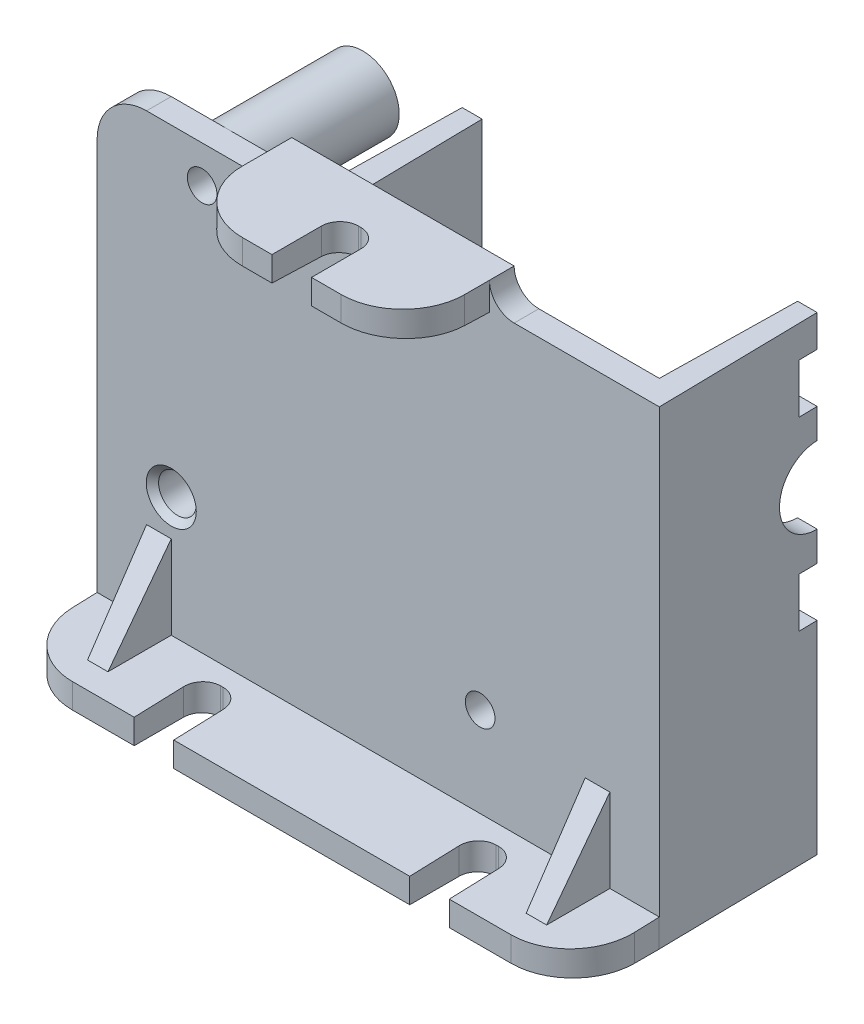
ISO-10303-21;
HEADER;
FILE_DESCRIPTION(('STEP AP214'),'2;1');
FILE_NAME('part.step','',(''),(''),'','','');
FILE_SCHEMA(('AUTOMOTIVE_DESIGN { 1 0 10303 214 1 1 1 1 }'));
ENDSEC;
DATA;
#1=APPLICATION_CONTEXT('core data for automotive mechanical design processes');
#2=APPLICATION_PROTOCOL_DEFINITION('international standard','automotive_design',2000,#1);
#3=PRODUCT_CONTEXT('',#1,'mechanical');
#4=PRODUCT('Part','Part','',(#3));
#5=PRODUCT_RELATED_PRODUCT_CATEGORY('part','',(#4));
#6=PRODUCT_DEFINITION_FORMATION('','',#4);
#7=PRODUCT_DEFINITION_CONTEXT('part definition',#1,'design');
#8=PRODUCT_DEFINITION('design','',#6,#7);
#9=PRODUCT_DEFINITION_SHAPE('','',#8);
#10=(LENGTH_UNIT() NAMED_UNIT(*) SI_UNIT(.MILLI.,.METRE.));
#11=(NAMED_UNIT(*) PLANE_ANGLE_UNIT() SI_UNIT($,.RADIAN.));
#12=(NAMED_UNIT(*) SI_UNIT($,.STERADIAN.) SOLID_ANGLE_UNIT());
#13=UNCERTAINTY_MEASURE_WITH_UNIT(LENGTH_MEASURE(1.E-05),#10,'distance_accuracy_value','');
#14=(GEOMETRIC_REPRESENTATION_CONTEXT(3) GLOBAL_UNCERTAINTY_ASSIGNED_CONTEXT((#13)) GLOBAL_UNIT_ASSIGNED_CONTEXT((#10,
#11,#12)) REPRESENTATION_CONTEXT('',''));
#15=CARTESIAN_POINT('',(0.,0.,0.));
#16=DIRECTION('',(0.,0.,1.));
#17=DIRECTION('',(1.,0.,0.));
#18=AXIS2_PLACEMENT_3D('',#15,#16,#17);
#19=CARTESIAN_POINT('',(25.2815897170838,78.3949429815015,1.27442327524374E-12));
#20=DIRECTION('',(0.,-1.,0.));
#21=DIRECTION('',(0.,0.,-1.));
#22=AXIS2_PLACEMENT_3D('',#19,#20,#21);
#23=PLANE('',#22);
#24=DIRECTION('',(0.017452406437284,0.,0.999847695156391));
#25=VECTOR('',#24,1.);
#26=CARTESIAN_POINT('',(70.9947495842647,78.3949429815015,-0.797926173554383));
#27=LINE('',#26,#25);
#28=CARTESIAN_POINT('',(70.7806270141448,78.3949429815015,-13.0649999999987));
#29=VERTEX_POINT('',#28);
#30=CARTESIAN_POINT('',(71.008677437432,78.3949429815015,1.27442327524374E-12));
#31=VERTEX_POINT('',#30);
#32=EDGE_CURVE('E507',#29,#31,#27,.T.);
#33=ORIENTED_EDGE('',*,*,#32,.F.);
#34=DIRECTION('',(-1.,0.,0.));
#35=VECTOR('',#34,1.);
#36=CARTESIAN_POINT('',(25.2815897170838,78.3949429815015,-13.0649999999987));
#37=LINE('',#36,#35);
#38=CARTESIAN_POINT('',(69.1920554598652,78.3949429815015,-13.0649999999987));
#39=VERTEX_POINT('',#38);
#40=EDGE_CURVE('E434',#29,#39,#37,.T.);
#41=ORIENTED_EDGE('',*,*,#40,.T.);
#42=DIRECTION('',(-0.0174524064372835,0.,0.999847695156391));
#43=VECTOR('',#42,1.);
#44=CARTESIAN_POINT('',(68.9990897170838,78.3949429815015,-2.00999999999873));
#45=LINE('',#44,#43);
#46=CARTESIAN_POINT('',(68.9990897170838,78.3949429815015,-2.00999999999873));
#47=VERTEX_POINT('',#46);
#48=EDGE_CURVE('E731',#47,#39,#45,.F.);
#49=ORIENTED_EDGE('',*,*,#48,.F.);
#50=DIRECTION('',(1.,0.,0.));
#51=VECTOR('',#50,1.);
#52=CARTESIAN_POINT('',(68.9990897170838,78.3949429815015,-2.00999999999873));
#53=LINE('',#52,#51);
#54=CARTESIAN_POINT('',(59.2003397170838,78.3949429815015,-2.00999999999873));
#55=VERTEX_POINT('',#54);
#56=EDGE_CURVE('E732',#55,#47,#53,.T.);
#57=ORIENTED_EDGE('',*,*,#56,.F.);
#58=DIRECTION('',(0.,0.,-1.));
#59=VECTOR('',#58,1.);
#60=CARTESIAN_POINT('',(59.2003397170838,78.3949429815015,1.27442327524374E-12));
#61=LINE('',#60,#59);
#62=CARTESIAN_POINT('',(59.2003397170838,78.3949429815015,1.27442327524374E-12));
#63=VERTEX_POINT('',#62);
#64=EDGE_CURVE('E824',#55,#63,#61,.F.);
#65=ORIENTED_EDGE('',*,*,#64,.T.);
#66=DIRECTION('',(-1.,0.,0.));
#67=VECTOR('',#66,1.);
#68=CARTESIAN_POINT('',(25.2815897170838,78.3949429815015,1.27442327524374E-12));
#69=LINE('',#68,#67);
#70=EDGE_CURVE('E737',#31,#63,#69,.T.);
#71=ORIENTED_EDGE('',*,*,#70,.F.);
#72=EDGE_LOOP('',(#33,#41,#49,#57,#65,#71));
#73=FACE_BOUND('',#72,.T.);
#74=ADVANCED_FACE('F16',(#73),#23,.F.);
#75=CARTESIAN_POINT('',(71.0090897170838,40.2049429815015,1.27442327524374E-12));
#76=DIRECTION('',(0.,0.,1.));
#77=DIRECTION('',(1.,0.,0.));
#78=AXIS2_PLACEMENT_3D('',#75,#76,#77);
#79=PLANE('',#78);
#80=CARTESIAN_POINT('',(33.8240897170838,75.3799429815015,1.27442327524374E-12));
#81=DIRECTION('',(0.,0.,1.));
#82=DIRECTION('',(1.,0.,0.));
#83=AXIS2_PLACEMENT_3D('',#80,#81,#82);
#84=CIRCLE('',#83,1.206);
#85=CARTESIAN_POINT('',(35.0300897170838,75.3799429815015,1.27442327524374E-12));
#86=VERTEX_POINT('',#85);
#87=EDGE_CURVE('E689',#86,#86,#84,.T.);
#88=ORIENTED_EDGE('',*,*,#87,.F.);
#89=EDGE_LOOP('',(#88));
#90=FACE_BOUND('',#89,.T.);
#91=CARTESIAN_POINT('',(56.4365897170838,49.7524429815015,1.27442327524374E-12));
#92=DIRECTION('',(0.,0.,1.));
#93=DIRECTION('',(1.,0.,0.));
#94=AXIS2_PLACEMENT_3D('',#91,#92,#93);
#95=CIRCLE('',#94,1.206);
#96=CARTESIAN_POINT('',(57.6425897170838,49.7524429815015,1.27442327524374E-12));
#97=VERTEX_POINT('',#96);
#98=EDGE_CURVE('E685',#97,#97,#95,.T.);
#99=ORIENTED_EDGE('',*,*,#98,.F.);
#100=EDGE_LOOP('',(#99));
#101=FACE_BOUND('',#100,.T.);
#102=CARTESIAN_POINT('',(31.3115897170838,52.1845429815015,1.27442327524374E-12));
#103=DIRECTION('',(0.,0.,1.));
#104=DIRECTION('',(1.,0.,0.));
#105=AXIS2_PLACEMENT_3D('',#102,#103,#104);
#106=CIRCLE('',#105,2.035125);
#107=CARTESIAN_POINT('',(33.3467147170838,52.1845429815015,1.27442327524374E-12));
#108=VERTEX_POINT('',#107);
#109=EDGE_CURVE('E789',#108,#108,#106,.F.);
#110=ORIENTED_EDGE('',*,*,#109,.T.);
#111=EDGE_LOOP('',(#110));
#112=FACE_BOUND('',#111,.T.);
#113=DIRECTION('',(-1.,0.,0.));
#114=VECTOR('',#113,1.);
#115=CARTESIAN_POINT('',(71.0090897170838,42.460610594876,1.27442327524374E-12));
#116=LINE('',#115,#114);
#117=CARTESIAN_POINT('',(66.9890897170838,42.460610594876,1.27442327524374E-12));
#118=VERTEX_POINT('',#117);
#119=CARTESIAN_POINT('',(71.008677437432,42.460610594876,1.27355157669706E-12));
#120=VERTEX_POINT('',#119);
#121=EDGE_CURVE('E929',#118,#120,#116,.F.);
#122=ORIENTED_EDGE('',*,*,#121,.T.);
#123=DIRECTION('',(0.,1.,0.));
#124=VECTOR('',#123,1.);
#125=CARTESIAN_POINT('',(71.008677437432,40.2049429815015,1.27442327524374E-12));
#126=LINE('',#125,#124);
#127=EDGE_CURVE('E32',#120,#31,#126,.T.);
#128=ORIENTED_EDGE('',*,*,#127,.T.);
#129=ORIENTED_EDGE('',*,*,#70,.T.);
#130=CARTESIAN_POINT('',(59.2003397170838,80.4049429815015,1.27442327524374E-12));
#131=DIRECTION('',(0.,0.,1.));
#132=DIRECTION('',(1.,0.,0.));
#133=AXIS2_PLACEMENT_3D('',#130,#131,#132);
#134=CIRCLE('',#133,2.01);
#135=CARTESIAN_POINT('',(57.1903397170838,80.4049429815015,1.27442327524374E-12));
#136=VERTEX_POINT('',#135);
#137=EDGE_CURVE('E838',#63,#136,#134,.F.);
#138=ORIENTED_EDGE('',*,*,#137,.T.);
#139=DIRECTION('',(0.,1.,0.));
#140=VECTOR('',#139,1.);
#141=CARTESIAN_POINT('',(57.1903397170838,80.4049429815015,1.27442327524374E-12));
#142=LINE('',#141,#140);
#143=CARTESIAN_POINT('',(57.1903397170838,78.1492753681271,1.27442327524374E-12));
#144=VERTEX_POINT('',#143);
#145=EDGE_CURVE('E820',#144,#136,#142,.T.);
#146=ORIENTED_EDGE('',*,*,#145,.F.);
#147=DIRECTION('',(1.,0.,0.));
#148=VECTOR('',#147,1.);
#149=CARTESIAN_POINT('',(71.0090897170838,78.1492753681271,1.27442327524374E-12));
#150=LINE('',#149,#148);
#151=CARTESIAN_POINT('',(39.1003397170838,78.1492753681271,1.27442327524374E-12));
#152=VERTEX_POINT('',#151);
#153=EDGE_CURVE('E561',#152,#144,#150,.T.);
#154=ORIENTED_EDGE('',*,*,#153,.F.);
#155=DIRECTION('',(0.,-1.,0.));
#156=VECTOR('',#155,1.);
#157=CARTESIAN_POINT('',(39.1003397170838,80.4049429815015,1.27442327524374E-12));
#158=LINE('',#157,#156);
#159=CARTESIAN_POINT('',(39.1003397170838,80.4049429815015,1.27442327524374E-12));
#160=VERTEX_POINT('',#159);
#161=EDGE_CURVE('E829',#160,#152,#158,.T.);
#162=ORIENTED_EDGE('',*,*,#161,.F.);
#163=CARTESIAN_POINT('',(37.0903397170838,80.4049429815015,1.27442327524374E-12));
#164=DIRECTION('',(0.,0.,1.));
#165=DIRECTION('',(1.,0.,0.));
#166=AXIS2_PLACEMENT_3D('',#163,#164,#165);
#167=CIRCLE('',#166,2.01);
#168=CARTESIAN_POINT('',(37.0903397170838,78.3949429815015,1.27442327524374E-12));
#169=VERTEX_POINT('',#168);
#170=EDGE_CURVE('E842',#160,#169,#167,.F.);
#171=ORIENTED_EDGE('',*,*,#170,.T.);
#172=CARTESIAN_POINT('',(29.3015897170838,78.3949429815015,1.27442327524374E-12));
#173=VERTEX_POINT('',#172);
#174=EDGE_CURVE('E741',#169,#173,#69,.T.);
#175=ORIENTED_EDGE('',*,*,#174,.T.);
#176=CARTESIAN_POINT('',(29.3015897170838,74.3749429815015,1.27442327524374E-12));
#177=DIRECTION('',(0.,0.,1.));
#178=DIRECTION('',(1.,0.,0.));
#179=AXIS2_PLACEMENT_3D('',#176,#177,#178);
#180=CIRCLE('',#179,4.02);
#181=CARTESIAN_POINT('',(25.2815897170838,74.3749429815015,1.27442327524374E-12));
#182=VERTEX_POINT('',#181);
#183=EDGE_CURVE('E778',#173,#182,#180,.T.);
#184=ORIENTED_EDGE('',*,*,#183,.T.);
#185=DIRECTION('',(0.,-1.,0.));
#186=VECTOR('',#185,1.);
#187=CARTESIAN_POINT('',(25.2815897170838,78.3949429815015,1.27442327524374E-12));
#188=LINE('',#187,#186);
#189=CARTESIAN_POINT('',(25.2815897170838,42.460610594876,1.27442327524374E-12));
#190=VERTEX_POINT('',#189);
#191=EDGE_CURVE('E740',#182,#190,#188,.T.);
#192=ORIENTED_EDGE('',*,*,#191,.T.);
#193=DIRECTION('',(-1.,0.,0.));
#194=VECTOR('',#193,1.);
#195=CARTESIAN_POINT('',(71.0090897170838,42.460610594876,1.27442327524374E-12));
#196=LINE('',#195,#194);
#197=CARTESIAN_POINT('',(29.3015897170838,42.460610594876,1.27442327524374E-12));
#198=VERTEX_POINT('',#197);
#199=EDGE_CURVE('E928',#190,#198,#196,.F.);
#200=ORIENTED_EDGE('',*,*,#199,.T.);
#201=DIRECTION('',(0.,-1.,0.));
#202=VECTOR('',#201,1.);
#203=CARTESIAN_POINT('',(29.3015897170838,40.2049429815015,1.27442327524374E-12));
#204=LINE('',#203,#202);
#205=CARTESIAN_POINT('',(29.3015897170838,49.2499429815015,1.27442327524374E-12));
#206=VERTEX_POINT('',#205);
#207=EDGE_CURVE('E857',#198,#206,#204,.F.);
#208=ORIENTED_EDGE('',*,*,#207,.T.);
#209=DIRECTION('',(-1.,0.,0.));
#210=VECTOR('',#209,1.);
#211=CARTESIAN_POINT('',(71.0090897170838,49.2499429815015,1.27442327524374E-12));
#212=LINE('',#211,#210);
#213=CARTESIAN_POINT('',(31.3115897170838,49.2499429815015,1.27442327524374E-12));
#214=VERTEX_POINT('',#213);
#215=EDGE_CURVE('E815',#214,#206,#212,.T.);
#216=ORIENTED_EDGE('',*,*,#215,.F.);
#217=DIRECTION('',(0.,1.,0.));
#218=VECTOR('',#217,1.);
#219=CARTESIAN_POINT('',(31.3115897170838,40.2049429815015,1.27442327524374E-12));
#220=LINE('',#219,#218);
#221=CARTESIAN_POINT('',(31.3115897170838,42.460610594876,1.27442327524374E-12));
#222=VERTEX_POINT('',#221);
#223=EDGE_CURVE('E861',#214,#222,#220,.F.);
#224=ORIENTED_EDGE('',*,*,#223,.T.);
#225=DIRECTION('',(-1.,0.,0.));
#226=VECTOR('',#225,1.);
#227=CARTESIAN_POINT('',(71.0090897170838,42.460610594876,1.27442327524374E-12));
#228=LINE('',#227,#226);
#229=CARTESIAN_POINT('',(64.9790897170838,42.460610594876,1.27442327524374E-12));
#230=VERTEX_POINT('',#229);
#231=EDGE_CURVE('E925',#222,#230,#228,.F.);
#232=ORIENTED_EDGE('',*,*,#231,.T.);
#233=DIRECTION('',(0.,-1.,0.));
#234=VECTOR('',#233,1.);
#235=CARTESIAN_POINT('',(64.9790897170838,40.2049429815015,1.27442327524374E-12));
#236=LINE('',#235,#234);
#237=CARTESIAN_POINT('',(64.9790897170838,49.2499429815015,1.27442327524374E-12));
#238=VERTEX_POINT('',#237);
#239=EDGE_CURVE('E869',#230,#238,#236,.F.);
#240=ORIENTED_EDGE('',*,*,#239,.T.);
#241=DIRECTION('',(-1.,0.,0.));
#242=VECTOR('',#241,1.);
#243=CARTESIAN_POINT('',(71.0090897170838,49.2499429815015,1.27442327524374E-12));
#244=LINE('',#243,#242);
#245=CARTESIAN_POINT('',(66.9890897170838,49.2499429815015,1.27442327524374E-12));
#246=VERTEX_POINT('',#245);
#247=EDGE_CURVE('E809',#246,#238,#244,.T.);
#248=ORIENTED_EDGE('',*,*,#247,.F.);
#249=DIRECTION('',(0.,1.,0.));
#250=VECTOR('',#249,1.);
#251=CARTESIAN_POINT('',(66.9890897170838,40.2049429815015,1.27442327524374E-12));
#252=LINE('',#251,#250);
#253=EDGE_CURVE('E568',#246,#118,#252,.F.);
#254=ORIENTED_EDGE('',*,*,#253,.T.);
#255=EDGE_LOOP('',(#122,#128,#129,#138,#146,#154,#162,#171,#175,#184,#192,#200,#208,#216,#224,
#232,#240,#248,#254));
#256=FACE_BOUND('',#255,.T.);
#257=ADVANCED_FACE('F3183',(#90,#101,#112,#256),#79,.T.);
#258=CARTESIAN_POINT('',(25.2815897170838,42.2149429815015,7.03500000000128));
#259=DIRECTION('',(0.,0.999390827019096,0.0348994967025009));
#260=DIRECTION('',(0.,0.0348994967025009,-0.999390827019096));
#261=AXIS2_PLACEMENT_3D('',#258,#259,#260);
#262=PLANE('',#261);
#263=DIRECTION('',(-0.017441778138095,0.0348941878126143,-0.999238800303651));
#264=VECTOR('',#263,1.);
#265=CARTESIAN_POINT('',(71.1175255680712,42.2428479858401,6.23590522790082));
#266=LINE('',#265,#264);
#267=CARTESIAN_POINT('',(71.0090897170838,42.4597857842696,0.0236194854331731));
#268=VERTEX_POINT('',#267);
#269=EDGE_CURVE('E40',#120,#268,#266,.F.);
#270=ORIENTED_EDGE('',*,*,#269,.F.);
#271=ORIENTED_EDGE('',*,*,#121,.F.);
#272=DIRECTION('',(0.0348782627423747,0.0348782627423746,-0.998782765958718));
#273=VECTOR('',#272,1.);
#274=CARTESIAN_POINT('',(66.692984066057,42.1645049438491,8.47935642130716));
#275=LINE('',#274,#273);
#276=CARTESIAN_POINT('',(66.8154084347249,42.286929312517,4.97358119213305));
#277=VERTEX_POINT('',#276);
#278=EDGE_CURVE('E880',#277,#118,#275,.T.);
#279=ORIENTED_EDGE('',*,*,#278,.F.);
#280=DIRECTION('',(-1.,0.,0.));
#281=VECTOR('',#280,1.);
#282=CARTESIAN_POINT('',(66.9890897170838,42.286929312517,4.97358119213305));
#283=LINE('',#282,#281);
#284=CARTESIAN_POINT('',(65.1527709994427,42.286929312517,4.97358119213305));
#285=VERTEX_POINT('',#284);
#286=EDGE_CURVE('E875',#285,#277,#283,.F.);
#287=ORIENTED_EDGE('',*,*,#286,.F.);
#288=DIRECTION('',(0.0348782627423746,-0.0348782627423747,0.998782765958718));
#289=VECTOR('',#288,1.);
#290=CARTESIAN_POINT('',(65.1761667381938,42.263533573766,5.64354749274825));
#291=LINE('',#290,#289);
#292=EDGE_CURVE('E814',#230,#285,#291,.T.);
#293=ORIENTED_EDGE('',*,*,#292,.F.);
#294=ORIENTED_EDGE('',*,*,#231,.F.);
#295=DIRECTION('',(0.0348782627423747,0.0348782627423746,-0.998782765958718));
#296=VECTOR('',#295,1.);
#297=CARTESIAN_POINT('',(31.0588855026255,42.2079063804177,7.23650189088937));
#298=LINE('',#297,#296);
#299=CARTESIAN_POINT('',(31.1379084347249,42.286929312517,4.97358119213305));
#300=VERTEX_POINT('',#299);
#301=EDGE_CURVE('E921',#300,#222,#298,.T.);
#302=ORIENTED_EDGE('',*,*,#301,.F.);
#303=DIRECTION('',(-1.,0.,0.));
#304=VECTOR('',#303,1.);
#305=CARTESIAN_POINT('',(31.3115897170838,42.286929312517,4.97358119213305));
#306=LINE('',#305,#304);
#307=CARTESIAN_POINT('',(29.4752709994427,42.286929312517,4.97358119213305));
#308=VERTEX_POINT('',#307);
#309=EDGE_CURVE('E862',#308,#300,#306,.F.);
#310=ORIENTED_EDGE('',*,*,#309,.F.);
#311=DIRECTION('',(0.0348782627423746,-0.0348782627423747,0.998782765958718));
#312=VECTOR('',#311,1.);
#313=CARTESIAN_POINT('',(29.5420681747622,42.2201321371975,6.88640202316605));
#314=LINE('',#313,#312);
#315=EDGE_CURVE('E813',#198,#308,#314,.T.);
#316=ORIENTED_EDGE('',*,*,#315,.F.);
#317=ORIENTED_EDGE('',*,*,#199,.F.);
#318=DIRECTION('',(0.,-0.0348994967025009,0.999390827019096));
#319=VECTOR('',#318,1.);
#320=CARTESIAN_POINT('',(25.2815897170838,42.5043777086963,-1.25332615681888));
#321=LINE('',#320,#319);
#322=CARTESIAN_POINT('',(25.2815897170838,42.3904198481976,2.01000000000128));
#323=VERTEX_POINT('',#322);
#324=EDGE_CURVE('E711',#323,#190,#321,.F.);
#325=ORIENTED_EDGE('',*,*,#324,.F.);
#326=CARTESIAN_POINT('',(30.3065897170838,42.3904198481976,2.01000000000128));
#327=DIRECTION('',(0.,0.999390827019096,0.0348994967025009));
#328=DIRECTION('',(0.,0.0348994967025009,-0.999390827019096));
#329=AXIS2_PLACEMENT_3D('',#326,#327,#328);
#330=ELLIPSE('',#329,5.02806296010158,5.025);
#331=CARTESIAN_POINT('',(30.3065897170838,42.2149429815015,7.03500000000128));
#332=VERTEX_POINT('',#331);
#333=EDGE_CURVE('E889',#323,#332,#330,.T.);
#334=ORIENTED_EDGE('',*,*,#333,.T.);
#335=DIRECTION('',(1.,0.,0.));
#336=VECTOR('',#335,1.);
#337=CARTESIAN_POINT('',(25.2815897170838,42.2149429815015,7.03500000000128));
#338=LINE('',#337,#336);
#339=CARTESIAN_POINT('',(35.3315897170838,42.2149429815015,7.03500000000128));
#340=VERTEX_POINT('',#339);
#341=EDGE_CURVE('E945',#340,#332,#338,.F.);
#342=ORIENTED_EDGE('',*,*,#341,.F.);
#343=DIRECTION('',(0.,0.0348994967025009,-0.999390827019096));
#344=VECTOR('',#343,1.);
#345=CARTESIAN_POINT('',(35.3315897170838,42.1572575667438,8.68689414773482));
#346=LINE('',#345,#344);
#347=CARTESIAN_POINT('',(35.3315897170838,42.3553244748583,3.01500000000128));
#348=VERTEX_POINT('',#347);
#349=EDGE_CURVE('E630',#348,#340,#346,.F.);
#350=ORIENTED_EDGE('',*,*,#349,.F.);
#351=CARTESIAN_POINT('',(36.8390897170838,42.3553244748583,3.01500000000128));
#352=DIRECTION('',(0.,0.999390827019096,0.0348994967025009));
#353=DIRECTION('',(0.,0.0348994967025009,-0.999390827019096));
#354=AXIS2_PLACEMENT_3D('',#351,#352,#353);
#355=ELLIPSE('',#354,1.50841888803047,1.5075);
#356=CARTESIAN_POINT('',(36.8390897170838,42.4079675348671,1.50750000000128));
#357=VERTEX_POINT('',#356);
#358=EDGE_CURVE('E981',#357,#348,#355,.T.);
#359=ORIENTED_EDGE('',*,*,#358,.F.);
#360=DIRECTION('',(1.,0.,0.));
#361=VECTOR('',#360,1.);
#362=CARTESIAN_POINT('',(36.8390897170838,42.4079675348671,1.50750000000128));
#363=LINE('',#362,#361);
#364=CARTESIAN_POINT('',(37.0400897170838,42.4079675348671,1.50750000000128));
#365=VERTEX_POINT('',#364);
#366=EDGE_CURVE('E977',#365,#357,#363,.F.);
#367=ORIENTED_EDGE('',*,*,#366,.F.);
#368=CARTESIAN_POINT('',(37.0400897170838,42.3553244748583,3.01500000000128));
#369=DIRECTION('',(0.,0.999390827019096,0.0348994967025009));
#370=DIRECTION('',(0.,0.0348994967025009,-0.999390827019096));
#371=AXIS2_PLACEMENT_3D('',#368,#369,#370);
#372=ELLIPSE('',#371,1.50841888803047,1.5075);
#373=CARTESIAN_POINT('',(38.5475897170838,42.3553244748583,3.01500000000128));
#374=VERTEX_POINT('',#373);
#375=EDGE_CURVE('E621',#374,#365,#372,.T.);
#376=ORIENTED_EDGE('',*,*,#375,.F.);
#377=DIRECTION('',(0.,0.0348994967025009,-0.999390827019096));
#378=VECTOR('',#377,1.);
#379=CARTESIAN_POINT('',(38.5475897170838,42.2149429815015,7.03500000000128));
#380=LINE('',#379,#378);
#381=CARTESIAN_POINT('',(38.5475897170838,42.2149429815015,7.03500000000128));
#382=VERTEX_POINT('',#381);
#383=EDGE_CURVE('E955',#374,#382,#380,.F.);
#384=ORIENTED_EDGE('',*,*,#383,.T.);
#385=DIRECTION('',(1.,0.,0.));
#386=VECTOR('',#385,1.);
#387=CARTESIAN_POINT('',(25.2815897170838,42.2149429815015,7.03500000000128));
#388=LINE('',#387,#386);
#389=CARTESIAN_POINT('',(57.7430897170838,42.2149429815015,7.03500000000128));
#390=VERTEX_POINT('',#389);
#391=EDGE_CURVE('E951',#390,#382,#388,.F.);
#392=ORIENTED_EDGE('',*,*,#391,.F.);
#393=DIRECTION('',(0.,0.0348994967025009,-0.999390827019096));
#394=VECTOR('',#393,1.);
#395=CARTESIAN_POINT('',(57.7430897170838,42.1572575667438,8.68689414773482));
#396=LINE('',#395,#394);
#397=CARTESIAN_POINT('',(57.7430897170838,42.3553244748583,3.01500000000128));
#398=VERTEX_POINT('',#397);
#399=EDGE_CURVE('E660',#398,#390,#396,.F.);
#400=ORIENTED_EDGE('',*,*,#399,.F.);
#401=CARTESIAN_POINT('',(59.2505897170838,42.3553244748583,3.01500000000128));
#402=DIRECTION('',(0.,0.999390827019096,0.0348994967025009));
#403=DIRECTION('',(0.,0.0348994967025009,-0.999390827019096));
#404=AXIS2_PLACEMENT_3D('',#401,#402,#403);
#405=ELLIPSE('',#404,1.50841888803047,1.5075);
#406=CARTESIAN_POINT('',(59.2505897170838,42.4079675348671,1.50750000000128));
#407=VERTEX_POINT('',#406);
#408=EDGE_CURVE('E962',#407,#398,#405,.T.);
#409=ORIENTED_EDGE('',*,*,#408,.F.);
#410=DIRECTION('',(1.,0.,0.));
#411=VECTOR('',#410,1.);
#412=CARTESIAN_POINT('',(59.4515897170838,42.4079675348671,1.50750000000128));
#413=LINE('',#412,#411);
#414=CARTESIAN_POINT('',(59.4515897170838,42.4079675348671,1.50750000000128));
#415=VERTEX_POINT('',#414);
#416=EDGE_CURVE('E958',#415,#407,#413,.F.);
#417=ORIENTED_EDGE('',*,*,#416,.F.);
#418=CARTESIAN_POINT('',(59.4515897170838,42.3553244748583,3.01500000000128));
#419=DIRECTION('',(0.,0.999390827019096,0.0348994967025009));
#420=DIRECTION('',(0.,0.0348994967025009,-0.999390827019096));
#421=AXIS2_PLACEMENT_3D('',#418,#419,#420);
#422=ELLIPSE('',#421,1.50841888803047,1.5075);
#423=CARTESIAN_POINT('',(60.9590897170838,42.3553244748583,3.01500000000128));
#424=VERTEX_POINT('',#423);
#425=EDGE_CURVE('E654',#424,#415,#422,.T.);
#426=ORIENTED_EDGE('',*,*,#425,.F.);
#427=DIRECTION('',(0.,0.0348994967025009,-0.999390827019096));
#428=VECTOR('',#427,1.);
#429=CARTESIAN_POINT('',(60.9590897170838,42.2149429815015,7.03500000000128));
#430=LINE('',#429,#428);
#431=CARTESIAN_POINT('',(60.9590897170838,42.2149429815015,7.03500000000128));
#432=VERTEX_POINT('',#431);
#433=EDGE_CURVE('E698',#424,#432,#430,.F.);
#434=ORIENTED_EDGE('',*,*,#433,.T.);
#435=DIRECTION('',(1.,0.,0.));
#436=VECTOR('',#435,1.);
#437=CARTESIAN_POINT('',(25.2815897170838,42.2149429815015,7.03500000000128));
#438=LINE('',#437,#436);
#439=CARTESIAN_POINT('',(65.9840897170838,42.2149429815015,7.03500000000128));
#440=VERTEX_POINT('',#439);
#441=EDGE_CURVE('E941',#440,#432,#438,.F.);
#442=ORIENTED_EDGE('',*,*,#441,.F.);
#443=CARTESIAN_POINT('',(65.9840897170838,42.3904198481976,2.01000000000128));
#444=DIRECTION('',(0.,0.999390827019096,0.0348994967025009));
#445=DIRECTION('',(0.,0.0348994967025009,-0.999390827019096));
#446=AXIS2_PLACEMENT_3D('',#443,#444,#445);
#447=ELLIPSE('',#446,5.02806296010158,5.025);
#448=CARTESIAN_POINT('',(71.0090897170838,42.3904198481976,2.01000000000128));
#449=VERTEX_POINT('',#448);
#450=EDGE_CURVE('E920',#440,#449,#447,.T.);
#451=ORIENTED_EDGE('',*,*,#450,.T.);
#452=DIRECTION('',(0.,0.0348994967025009,-0.999390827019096));
#453=VECTOR('',#452,1.);
#454=CARTESIAN_POINT('',(71.0090897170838,42.5043777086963,-1.25332615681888));
#455=LINE('',#454,#453);
#456=EDGE_CURVE('E942',#268,#449,#455,.F.);
#457=ORIENTED_EDGE('',*,*,#456,.F.);
#458=EDGE_LOOP('',(#270,#271,#279,#287,#293,#294,#302,#310,#316,#317,#325,#334,#342,#350,#359,
#367,#376,#384,#392,#400,#409,#417,#426,#434,#442,#451,#457));
#459=FACE_BOUND('',#458,.T.);
#460=ADVANCED_FACE('F3175',(#459),#262,.T.);
#461=CARTESIAN_POINT('',(71.0090897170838,78.3949429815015,1.27442327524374E-12));
#462=DIRECTION('',(-1.,0.,0.));
#463=DIRECTION('',(0.,0.,1.));
#464=AXIS2_PLACEMENT_3D('',#461,#462,#463);
#465=PLANE('',#464);
#466=DIRECTION('',(0.,-1.,0.));
#467=VECTOR('',#466,1.);
#468=CARTESIAN_POINT('',(71.0090897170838,78.3949429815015,0.0236194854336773));
#469=LINE('',#468,#467);
#470=CARTESIAN_POINT('',(71.0090897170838,40.2049429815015,0.0236194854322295));
#471=VERTEX_POINT('',#470);
#472=EDGE_CURVE('E499',#268,#471,#469,.T.);
#473=ORIENTED_EDGE('',*,*,#472,.F.);
#474=ORIENTED_EDGE('',*,*,#456,.T.);
#475=DIRECTION('',(0.,-1.,0.));
#476=VECTOR('',#475,1.);
#477=CARTESIAN_POINT('',(71.0090897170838,40.2049429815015,2.01000000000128));
#478=LINE('',#477,#476);
#479=CARTESIAN_POINT('',(71.0090897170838,40.2049429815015,2.01000000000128));
#480=VERTEX_POINT('',#479);
#481=EDGE_CURVE('E765',#449,#480,#478,.T.);
#482=ORIENTED_EDGE('',*,*,#481,.T.);
#483=DIRECTION('',(0.,0.,-1.));
#484=VECTOR('',#483,1.);
#485=CARTESIAN_POINT('',(71.0090897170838,40.2049429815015,1.27442327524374E-12));
#486=LINE('',#485,#484);
#487=EDGE_CURVE('E744',#480,#471,#486,.T.);
#488=ORIENTED_EDGE('',*,*,#487,.T.);
#489=EDGE_LOOP('',(#473,#474,#482,#488));
#490=FACE_BOUND('',#489,.T.);
#491=ADVANCED_FACE('F3168',(#490),#465,.F.);
#492=CARTESIAN_POINT('',(25.2815897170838,40.2049429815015,1.27442327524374E-12));
#493=DIRECTION('',(0.,1.,0.));
#494=DIRECTION('',(0.,0.,1.));
#495=AXIS2_PLACEMENT_3D('',#492,#493,#494);
#496=PLANE('',#495);
#497=DIRECTION('',(-0.017452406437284,0.,-0.999847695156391));
#498=VECTOR('',#497,1.);
#499=CARTESIAN_POINT('',(70.9947495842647,40.2049429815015,-0.797926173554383));
#500=LINE('',#499,#498);
#501=CARTESIAN_POINT('',(70.7806270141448,40.2049429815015,-13.0649999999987));
#502=VERTEX_POINT('',#501);
#503=EDGE_CURVE('E495',#471,#502,#500,.T.);
#504=ORIENTED_EDGE('',*,*,#503,.F.);
#505=ORIENTED_EDGE('',*,*,#487,.F.);
#506=CARTESIAN_POINT('',(65.9840897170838,40.2049429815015,2.01000000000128));
#507=DIRECTION('',(0.,1.,0.));
#508=DIRECTION('',(0.,0.,1.));
#509=AXIS2_PLACEMENT_3D('',#506,#507,#508);
#510=CIRCLE('',#509,5.025);
#511=CARTESIAN_POINT('',(65.9840897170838,40.2049429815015,7.03500000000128));
#512=VERTEX_POINT('',#511);
#513=EDGE_CURVE('E758',#480,#512,#510,.F.);
#514=ORIENTED_EDGE('',*,*,#513,.T.);
#515=DIRECTION('',(-1.,0.,0.));
#516=VECTOR('',#515,1.);
#517=CARTESIAN_POINT('',(25.2815897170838,40.2049429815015,7.03500000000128));
#518=LINE('',#517,#516);
#519=CARTESIAN_POINT('',(60.9590897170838,40.2049429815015,7.03500000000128));
#520=VERTEX_POINT('',#519);
#521=EDGE_CURVE('E708',#512,#520,#518,.T.);
#522=ORIENTED_EDGE('',*,*,#521,.T.);
#523=DIRECTION('',(0.,0.,-1.));
#524=VECTOR('',#523,1.);
#525=CARTESIAN_POINT('',(60.9590897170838,40.2049429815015,8.61871782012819));
#526=LINE('',#525,#524);
#527=CARTESIAN_POINT('',(60.9590897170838,40.2049429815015,3.01500000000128));
#528=VERTEX_POINT('',#527);
#529=EDGE_CURVE('E672',#520,#528,#526,.T.);
#530=ORIENTED_EDGE('',*,*,#529,.T.);
#531=CARTESIAN_POINT('',(59.4515897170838,40.2049429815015,3.01500000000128));
#532=DIRECTION('',(0.,1.,0.));
#533=DIRECTION('',(0.,0.,-1.));
#534=AXIS2_PLACEMENT_3D('',#531,#532,#533);
#535=CIRCLE('',#534,1.5075);
#536=CARTESIAN_POINT('',(59.4515897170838,40.2049429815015,1.50750000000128));
#537=VERTEX_POINT('',#536);
#538=EDGE_CURVE('E655',#528,#537,#535,.T.);
#539=ORIENTED_EDGE('',*,*,#538,.T.);
#540=DIRECTION('',(-1.,0.,0.));
#541=VECTOR('',#540,1.);
#542=CARTESIAN_POINT('',(59.4515897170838,40.2049429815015,1.50750000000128));
#543=LINE('',#542,#541);
#544=CARTESIAN_POINT('',(59.2505897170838,40.2049429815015,1.50750000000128));
#545=VERTEX_POINT('',#544);
#546=EDGE_CURVE('E659',#537,#545,#543,.T.);
#547=ORIENTED_EDGE('',*,*,#546,.T.);
#548=CARTESIAN_POINT('',(59.2505897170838,40.2049429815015,3.01500000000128));
#549=DIRECTION('',(0.,1.,0.));
#550=DIRECTION('',(0.,0.,-1.));
#551=AXIS2_PLACEMENT_3D('',#548,#549,#550);
#552=CIRCLE('',#551,1.5075);
#553=CARTESIAN_POINT('',(57.7430897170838,40.2049429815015,3.01500000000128));
#554=VERTEX_POINT('',#553);
#555=EDGE_CURVE('E664',#545,#554,#552,.T.);
#556=ORIENTED_EDGE('',*,*,#555,.T.);
#557=DIRECTION('',(0.,0.,1.));
#558=VECTOR('',#557,1.);
#559=CARTESIAN_POINT('',(57.7430897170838,40.2049429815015,8.61871782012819));
#560=LINE('',#559,#558);
#561=CARTESIAN_POINT('',(57.7430897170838,40.2049429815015,7.03500000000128));
#562=VERTEX_POINT('',#561);
#563=EDGE_CURVE('E668',#554,#562,#560,.T.);
#564=ORIENTED_EDGE('',*,*,#563,.T.);
#565=CARTESIAN_POINT('',(38.5475897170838,40.2049429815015,7.03500000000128));
#566=VERTEX_POINT('',#565);
#567=EDGE_CURVE('E712',#562,#566,#518,.T.);
#568=ORIENTED_EDGE('',*,*,#567,.T.);
#569=DIRECTION('',(0.,0.,-1.));
#570=VECTOR('',#569,1.);
#571=CARTESIAN_POINT('',(38.5475897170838,40.2049429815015,8.61871782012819));
#572=LINE('',#571,#570);
#573=CARTESIAN_POINT('',(38.5475897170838,40.2049429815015,3.01500000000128));
#574=VERTEX_POINT('',#573);
#575=EDGE_CURVE('E642',#566,#574,#572,.T.);
#576=ORIENTED_EDGE('',*,*,#575,.T.);
#577=CARTESIAN_POINT('',(37.0400897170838,40.2049429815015,3.01500000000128));
#578=DIRECTION('',(0.,1.,0.));
#579=DIRECTION('',(0.,0.,1.));
#580=AXIS2_PLACEMENT_3D('',#577,#578,#579);
#581=CIRCLE('',#580,1.5075);
#582=CARTESIAN_POINT('',(37.0400897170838,40.2049429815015,1.50750000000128));
#583=VERTEX_POINT('',#582);
#584=EDGE_CURVE('E625',#574,#583,#581,.T.);
#585=ORIENTED_EDGE('',*,*,#584,.T.);
#586=DIRECTION('',(-1.,0.,0.));
#587=VECTOR('',#586,1.);
#588=CARTESIAN_POINT('',(36.8390897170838,40.2049429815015,1.50750000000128));
#589=LINE('',#588,#587);
#590=CARTESIAN_POINT('',(36.8390897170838,40.2049429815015,1.50750000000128));
#591=VERTEX_POINT('',#590);
#592=EDGE_CURVE('E629',#583,#591,#589,.T.);
#593=ORIENTED_EDGE('',*,*,#592,.T.);
#594=CARTESIAN_POINT('',(36.8390897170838,40.2049429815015,3.01500000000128));
#595=DIRECTION('',(0.,1.,0.));
#596=DIRECTION('',(0.,0.,1.));
#597=AXIS2_PLACEMENT_3D('',#594,#595,#596);
#598=CIRCLE('',#597,1.5075);
#599=CARTESIAN_POINT('',(35.3315897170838,40.2049429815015,3.01500000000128));
#600=VERTEX_POINT('',#599);
#601=EDGE_CURVE('E634',#591,#600,#598,.T.);
#602=ORIENTED_EDGE('',*,*,#601,.T.);
#603=DIRECTION('',(0.,0.,1.));
#604=VECTOR('',#603,1.);
#605=CARTESIAN_POINT('',(35.3315897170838,40.2049429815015,8.61871782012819));
#606=LINE('',#605,#604);
#607=CARTESIAN_POINT('',(35.3315897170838,40.2049429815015,7.03500000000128));
#608=VERTEX_POINT('',#607);
#609=EDGE_CURVE('E638',#600,#608,#606,.T.);
#610=ORIENTED_EDGE('',*,*,#609,.T.);
#611=CARTESIAN_POINT('',(30.3065897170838,40.2049429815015,7.03500000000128));
#612=VERTEX_POINT('',#611);
#613=EDGE_CURVE('E707',#608,#612,#518,.T.);
#614=ORIENTED_EDGE('',*,*,#613,.T.);
#615=CARTESIAN_POINT('',(30.3065897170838,40.2049429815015,2.01000000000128));
#616=DIRECTION('',(0.,1.,0.));
#617=DIRECTION('',(0.,0.,1.));
#618=AXIS2_PLACEMENT_3D('',#615,#616,#617);
#619=CIRCLE('',#618,5.025);
#620=CARTESIAN_POINT('',(25.2815897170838,40.2049429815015,2.01000000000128));
#621=VERTEX_POINT('',#620);
#622=EDGE_CURVE('E761',#612,#621,#619,.F.);
#623=ORIENTED_EDGE('',*,*,#622,.T.);
#624=DIRECTION('',(0.,0.,-1.));
#625=VECTOR('',#624,1.);
#626=CARTESIAN_POINT('',(25.2815897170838,40.2049429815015,1.27442327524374E-12));
#627=LINE('',#626,#625);
#628=CARTESIAN_POINT('',(25.2815897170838,40.2049429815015,-2.00999999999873));
#629=VERTEX_POINT('',#628);
#630=EDGE_CURVE('E748',#621,#629,#627,.T.);
#631=ORIENTED_EDGE('',*,*,#630,.T.);
#632=DIRECTION('',(1.,0.,0.));
#633=VECTOR('',#632,1.);
#634=CARTESIAN_POINT('',(25.2815897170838,40.2049429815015,-2.00999999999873));
#635=LINE('',#634,#633);
#636=CARTESIAN_POINT('',(41.7133397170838,40.2049429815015,-2.00999999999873));
#637=VERTEX_POINT('',#636);
#638=EDGE_CURVE('E724',#629,#637,#635,.T.);
#639=ORIENTED_EDGE('',*,*,#638,.T.);
#640=DIRECTION('',(-0.0174524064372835,0.,0.999847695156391));
#641=VECTOR('',#640,1.);
#642=CARTESIAN_POINT('',(41.6732608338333,40.2049429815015,0.286117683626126));
#643=LINE('',#642,#641);
#644=CARTESIAN_POINT('',(41.9063054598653,40.2049429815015,-13.0649999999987));
#645=VERTEX_POINT('',#644);
#646=EDGE_CURVE('E703',#637,#645,#643,.F.);
#647=ORIENTED_EDGE('',*,*,#646,.T.);
#648=DIRECTION('',(1.,0.,0.));
#649=VECTOR('',#648,1.);
#650=CARTESIAN_POINT('',(25.2815897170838,40.2049429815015,-13.0649999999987));
#651=LINE('',#650,#649);
#652=CARTESIAN_POINT('',(43.5303739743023,40.2049429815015,-13.0649999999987));
#653=VERTEX_POINT('',#652);
#654=EDGE_CURVE('E578',#645,#653,#651,.T.);
#655=ORIENTED_EDGE('',*,*,#654,.T.);
#656=DIRECTION('',(-0.0174524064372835,0.,-0.999847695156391));
#657=VECTOR('',#656,1.);
#658=CARTESIAN_POINT('',(43.7527966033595,40.2049429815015,-0.322416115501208));
#659=LINE('',#658,#657);
#660=CARTESIAN_POINT('',(43.7233397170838,40.2049429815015,-2.00999999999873));
#661=VERTEX_POINT('',#660);
#662=EDGE_CURVE('E752',#653,#661,#659,.F.);
#663=ORIENTED_EDGE('',*,*,#662,.T.);
#664=DIRECTION('',(1.,0.,0.));
#665=VECTOR('',#664,1.);
#666=CARTESIAN_POINT('',(25.2815897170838,40.2049429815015,-2.00999999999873));
#667=LINE('',#666,#665);
#668=CARTESIAN_POINT('',(68.9990897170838,40.2049429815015,-2.00999999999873));
#669=VERTEX_POINT('',#668);
#670=EDGE_CURVE('E753',#661,#669,#667,.T.);
#671=ORIENTED_EDGE('',*,*,#670,.T.);
#672=DIRECTION('',(-0.0174524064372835,0.,0.999847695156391));
#673=VECTOR('',#672,1.);
#674=CARTESIAN_POINT('',(68.9506999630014,40.2049429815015,0.762247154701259));
#675=LINE('',#674,#673);
#676=CARTESIAN_POINT('',(69.1920554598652,40.2049429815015,-13.0649999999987));
#677=VERTEX_POINT('',#676);
#678=EDGE_CURVE('E757',#669,#677,#675,.F.);
#679=ORIENTED_EDGE('',*,*,#678,.T.);
#680=EDGE_CURVE('E573',#677,#502,#651,.T.);
#681=ORIENTED_EDGE('',*,*,#680,.T.);
#682=EDGE_LOOP('',(#504,#505,#514,#522,#530,#539,#547,#556,#564,#568,#576,#585,#593,#602,#610,
#614,#623,#631,#639,#647,#655,#663,#671,#679,#681));
#683=FACE_BOUND('',#682,.T.);
#684=ADVANCED_FACE('F1215',(#683),#496,.F.);
#685=CARTESIAN_POINT('',(67.9940897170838,66.2545429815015,-13.0649999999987));
#686=DIRECTION('',(1.,0.,0.));
#687=DIRECTION('',(0.,1.,0.));
#688=AXIS2_PLACEMENT_3D('',#685,#686,#687);
#689=CYLINDRICAL_SURFACE('',#688,3.1155);
#690=CARTESIAN_POINT('',(70.7806270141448,66.2545429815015,-13.0649999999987));
#691=DIRECTION('',(0.999847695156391,0.,-0.017452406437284));
#692=DIRECTION('',(0.017452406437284,0.,0.999847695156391));
#693=AXIS2_PLACEMENT_3D('',#690,#691,#692);
#694=ELLIPSE('',#693,3.11597457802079,3.1155);
#695=CARTESIAN_POINT('',(70.7806270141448,63.1390429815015,-13.0649999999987));
#696=VERTEX_POINT('',#695);
#697=CARTESIAN_POINT('',(70.7806270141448,69.3700429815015,-13.0649999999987));
#698=VERTEX_POINT('',#697);
#699=EDGE_CURVE('E445',#696,#698,#694,.F.);
#700=ORIENTED_EDGE('',*,*,#699,.F.);
#701=DIRECTION('',(1.,0.,0.));
#702=VECTOR('',#701,1.);
#703=CARTESIAN_POINT('',(67.9940897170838,63.1390429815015,-13.0649999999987));
#704=LINE('',#703,#702);
#705=CARTESIAN_POINT('',(69.1920554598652,63.1390429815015,-13.0649999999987));
#706=VERTEX_POINT('',#705);
#707=EDGE_CURVE('E588',#696,#706,#704,.F.);
#708=ORIENTED_EDGE('',*,*,#707,.T.);
#709=CARTESIAN_POINT('',(69.1920554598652,66.2545429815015,-13.0649999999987));
#710=DIRECTION('',(-0.999847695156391,0.,-0.0174524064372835));
#711=DIRECTION('',(0.0174524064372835,0.,-0.999847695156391));
#712=AXIS2_PLACEMENT_3D('',#709,#710,#711);
#713=ELLIPSE('',#712,3.11597457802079,3.1155);
#714=CARTESIAN_POINT('',(69.1920554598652,69.3700429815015,-13.0649999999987));
#715=VERTEX_POINT('',#714);
#716=EDGE_CURVE('E998',#715,#706,#713,.F.);
#717=ORIENTED_EDGE('',*,*,#716,.F.);
#718=DIRECTION('',(1.,0.,0.));
#719=VECTOR('',#718,1.);
#720=CARTESIAN_POINT('',(67.9940897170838,69.3700429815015,-13.0649999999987));
#721=LINE('',#720,#719);
#722=EDGE_CURVE('E597',#715,#698,#721,.T.);
#723=ORIENTED_EDGE('',*,*,#722,.T.);
#724=EDGE_LOOP('',(#700,#708,#717,#723));
#725=FACE_BOUND('',#724,.T.);
#726=ADVANCED_FACE('F3155',(#725),#689,.F.);
#727=CARTESIAN_POINT('',(67.9940897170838,71.7820429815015,-14.5724999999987));
#728=DIRECTION('',(0.,-1.,0.));
#729=DIRECTION('',(0.,0.,-1.));
#730=AXIS2_PLACEMENT_3D('',#727,#728,#729);
#731=PLANE('',#730);
#732=DIRECTION('',(0.017452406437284,0.,0.999847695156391));
#733=VECTOR('',#732,1.);
#734=CARTESIAN_POINT('',(70.7534727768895,71.7820429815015,-14.6206652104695));
#735=LINE('',#734,#733);
#736=CARTESIAN_POINT('',(70.7806270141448,71.7820429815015,-13.0649999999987));
#737=VERTEX_POINT('',#736);
#738=CARTESIAN_POINT('',(70.8069405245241,71.7820429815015,-11.5574999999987));
#739=VERTEX_POINT('',#738);
#740=EDGE_CURVE('E438',#737,#739,#735,.T.);
#741=ORIENTED_EDGE('',*,*,#740,.F.);
#742=DIRECTION('',(-1.,0.,0.));
#743=VECTOR('',#742,1.);
#744=CARTESIAN_POINT('',(67.9940897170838,71.7820429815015,-13.0649999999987));
#745=LINE('',#744,#743);
#746=CARTESIAN_POINT('',(69.1920554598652,71.7820429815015,-13.0649999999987));
#747=VERTEX_POINT('',#746);
#748=EDGE_CURVE('E425',#737,#747,#745,.T.);
#749=ORIENTED_EDGE('',*,*,#748,.T.);
#750=DIRECTION('',(-0.0174524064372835,0.,0.999847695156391));
#751=VECTOR('',#750,1.);
#752=CARTESIAN_POINT('',(68.9990897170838,71.7820429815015,-2.00999999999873));
#753=LINE('',#752,#751);
#754=CARTESIAN_POINT('',(69.165741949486,71.7820429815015,-11.5574999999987));
#755=VERTEX_POINT('',#754);
#756=EDGE_CURVE('E1134',#755,#747,#753,.F.);
#757=ORIENTED_EDGE('',*,*,#756,.F.);
#758=DIRECTION('',(1.,0.,0.));
#759=VECTOR('',#758,1.);
#760=CARTESIAN_POINT('',(67.9940897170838,71.7820429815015,-11.5574999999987));
#761=LINE('',#760,#759);
#762=EDGE_CURVE('E441',#755,#739,#761,.T.);
#763=ORIENTED_EDGE('',*,*,#762,.T.);
#764=EDGE_LOOP('',(#741,#749,#757,#763));
#765=FACE_BOUND('',#764,.T.);
#766=ADVANCED_FACE('F439',(#765),#731,.F.);
#767=CARTESIAN_POINT('',(67.9940897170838,71.7820429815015,-11.5574999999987));
#768=DIRECTION('',(0.,0.,1.));
#769=DIRECTION('',(1.,0.,0.));
#770=AXIS2_PLACEMENT_3D('',#767,#768,#769);
#771=PLANE('',#770);
#772=DIRECTION('',(0.,1.,0.));
#773=VECTOR('',#772,1.);
#774=CARTESIAN_POINT('',(70.8069405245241,71.7820429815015,-11.5574999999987));
#775=LINE('',#774,#773);
#776=CARTESIAN_POINT('',(70.8069405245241,75.8020429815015,-11.5574999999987));
#777=VERTEX_POINT('',#776);
#778=EDGE_CURVE('E473',#739,#777,#775,.T.);
#779=ORIENTED_EDGE('',*,*,#778,.F.);
#780=ORIENTED_EDGE('',*,*,#762,.F.);
#781=DIRECTION('',(0.,1.,0.));
#782=VECTOR('',#781,1.);
#783=CARTESIAN_POINT('',(69.1657419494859,38.1949429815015,-11.5574999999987));
#784=LINE('',#783,#782);
#785=CARTESIAN_POINT('',(69.165741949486,75.8020429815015,-11.5574999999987));
#786=VERTEX_POINT('',#785);
#787=EDGE_CURVE('E1147',#786,#755,#784,.F.);
#788=ORIENTED_EDGE('',*,*,#787,.F.);
#789=DIRECTION('',(1.,0.,0.));
#790=VECTOR('',#789,1.);
#791=CARTESIAN_POINT('',(67.9940897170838,75.8020429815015,-11.5574999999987));
#792=LINE('',#791,#790);
#793=EDGE_CURVE('E614',#786,#777,#792,.T.);
#794=ORIENTED_EDGE('',*,*,#793,.T.);
#795=EDGE_LOOP('',(#779,#780,#788,#794));
#796=FACE_BOUND('',#795,.T.);
#797=ADVANCED_FACE('F3140',(#796),#771,.F.);
#798=CARTESIAN_POINT('',(67.9940897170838,75.8020429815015,-14.5724999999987));
#799=DIRECTION('',(0.,1.,0.));
#800=DIRECTION('',(0.,0.,1.));
#801=AXIS2_PLACEMENT_3D('',#798,#799,#800);
#802=PLANE('',#801);
#803=DIRECTION('',(-0.017452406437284,0.,-0.999847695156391));
#804=VECTOR('',#803,1.);
#805=CARTESIAN_POINT('',(70.7534727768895,75.8020429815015,-14.6206652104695));
#806=LINE('',#805,#804);
#807=CARTESIAN_POINT('',(70.7806270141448,75.8020429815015,-13.0649999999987));
#808=VERTEX_POINT('',#807);
#809=EDGE_CURVE('E484',#777,#808,#806,.T.);
#810=ORIENTED_EDGE('',*,*,#809,.F.);
#811=ORIENTED_EDGE('',*,*,#793,.F.);
#812=DIRECTION('',(0.0174524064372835,0.,-0.999847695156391));
#813=VECTOR('',#812,1.);
#814=CARTESIAN_POINT('',(68.9990897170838,75.8020429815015,-2.00999999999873));
#815=LINE('',#814,#813);
#816=CARTESIAN_POINT('',(69.1920554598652,75.8020429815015,-13.0649999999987));
#817=VERTEX_POINT('',#816);
#818=EDGE_CURVE('E974',#817,#786,#815,.F.);
#819=ORIENTED_EDGE('',*,*,#818,.F.);
#820=DIRECTION('',(1.,0.,0.));
#821=VECTOR('',#820,1.);
#822=CARTESIAN_POINT('',(67.9940897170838,75.8020429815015,-13.0649999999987));
#823=LINE('',#822,#821);
#824=EDGE_CURVE('E583',#817,#808,#823,.T.);
#825=ORIENTED_EDGE('',*,*,#824,.T.);
#826=EDGE_LOOP('',(#810,#811,#819,#825));
#827=FACE_BOUND('',#826,.T.);
#828=ADVANCED_FACE('F3132',(#827),#802,.F.);
#829=CARTESIAN_POINT('',(67.9940897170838,60.7270429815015,-14.5724999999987));
#830=DIRECTION('',(0.,1.,0.));
#831=DIRECTION('',(0.,0.,1.));
#832=AXIS2_PLACEMENT_3D('',#829,#830,#831);
#833=PLANE('',#832);
#834=DIRECTION('',(-0.017452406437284,0.,-0.999847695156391));
#835=VECTOR('',#834,1.);
#836=CARTESIAN_POINT('',(70.7534727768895,60.7270429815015,-14.6206652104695));
#837=LINE('',#836,#835);
#838=CARTESIAN_POINT('',(70.8069405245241,60.7270429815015,-11.5574999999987));
#839=VERTEX_POINT('',#838);
#840=CARTESIAN_POINT('',(70.7806270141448,60.7270429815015,-13.0649999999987));
#841=VERTEX_POINT('',#840);
#842=EDGE_CURVE('E468',#839,#841,#837,.T.);
#843=ORIENTED_EDGE('',*,*,#842,.F.);
#844=DIRECTION('',(1.,0.,0.));
#845=VECTOR('',#844,1.);
#846=CARTESIAN_POINT('',(67.9940897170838,60.7270429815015,-11.5574999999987));
#847=LINE('',#846,#845);
#848=CARTESIAN_POINT('',(69.1657419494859,60.7270429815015,-11.5574999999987));
#849=VERTEX_POINT('',#848);
#850=EDGE_CURVE('E615',#849,#839,#847,.T.);
#851=ORIENTED_EDGE('',*,*,#850,.F.);
#852=DIRECTION('',(0.0174524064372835,0.,-0.999847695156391));
#853=VECTOR('',#852,1.);
#854=CARTESIAN_POINT('',(68.9990897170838,60.7270429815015,-2.00999999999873));
#855=LINE('',#854,#853);
#856=CARTESIAN_POINT('',(69.1920554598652,60.7270429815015,-13.0649999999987));
#857=VERTEX_POINT('',#856);
#858=EDGE_CURVE('E762',#857,#849,#855,.F.);
#859=ORIENTED_EDGE('',*,*,#858,.F.);
#860=DIRECTION('',(1.,0.,0.));
#861=VECTOR('',#860,1.);
#862=CARTESIAN_POINT('',(67.9940897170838,60.7270429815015,-13.0649999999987));
#863=LINE('',#862,#861);
#864=EDGE_CURVE('E576',#857,#841,#863,.T.);
#865=ORIENTED_EDGE('',*,*,#864,.T.);
#866=EDGE_LOOP('',(#843,#851,#859,#865));
#867=FACE_BOUND('',#866,.T.);
#868=ADVANCED_FACE('F3124',(#867),#833,.F.);
#869=CARTESIAN_POINT('',(67.9940897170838,56.7070429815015,-14.5724999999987));
#870=DIRECTION('',(0.,-1.,0.));
#871=DIRECTION('',(0.,0.,-1.));
#872=AXIS2_PLACEMENT_3D('',#869,#870,#871);
#873=PLANE('',#872);
#874=DIRECTION('',(0.017452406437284,0.,0.999847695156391));
#875=VECTOR('',#874,1.);
#876=CARTESIAN_POINT('',(70.7534727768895,56.7070429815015,-14.6206652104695));
#877=LINE('',#876,#875);
#878=CARTESIAN_POINT('',(70.7806270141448,56.7070429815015,-13.0649999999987));
#879=VERTEX_POINT('',#878);
#880=CARTESIAN_POINT('',(70.8069405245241,56.7070429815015,-11.5574999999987));
#881=VERTEX_POINT('',#880);
#882=EDGE_CURVE('E480',#879,#881,#877,.T.);
#883=ORIENTED_EDGE('',*,*,#882,.F.);
#884=DIRECTION('',(-1.,0.,0.));
#885=VECTOR('',#884,1.);
#886=CARTESIAN_POINT('',(67.9940897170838,56.7070429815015,-13.0649999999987));
#887=LINE('',#886,#885);
#888=CARTESIAN_POINT('',(69.1920554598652,56.7070429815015,-13.0649999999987));
#889=VERTEX_POINT('',#888);
#890=EDGE_CURVE('E797',#879,#889,#887,.T.);
#891=ORIENTED_EDGE('',*,*,#890,.T.);
#892=DIRECTION('',(-0.0174524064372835,0.,0.999847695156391));
#893=VECTOR('',#892,1.);
#894=CARTESIAN_POINT('',(68.9990897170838,56.7070429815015,-2.00999999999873));
#895=LINE('',#894,#893);
#896=CARTESIAN_POINT('',(69.1657419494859,56.7070429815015,-11.5574999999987));
#897=VERTEX_POINT('',#896);
#898=EDGE_CURVE('E1126',#897,#889,#895,.F.);
#899=ORIENTED_EDGE('',*,*,#898,.F.);
#900=DIRECTION('',(1.,0.,0.));
#901=VECTOR('',#900,1.);
#902=CARTESIAN_POINT('',(67.9940897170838,56.7070429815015,-11.5574999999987));
#903=LINE('',#902,#901);
#904=EDGE_CURVE('E610',#897,#881,#903,.T.);
#905=ORIENTED_EDGE('',*,*,#904,.T.);
#906=EDGE_LOOP('',(#883,#891,#899,#905));
#907=FACE_BOUND('',#906,.T.);
#908=ADVANCED_FACE('F3116',(#907),#873,.F.);
#909=CARTESIAN_POINT('',(67.9940897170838,60.7270429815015,-11.5574999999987));
#910=DIRECTION('',(0.,0.,1.));
#911=DIRECTION('',(1.,0.,0.));
#912=AXIS2_PLACEMENT_3D('',#909,#910,#911);
#913=PLANE('',#912);
#914=DIRECTION('',(0.,1.,0.));
#915=VECTOR('',#914,1.);
#916=CARTESIAN_POINT('',(70.8069405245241,60.7270429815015,-11.5574999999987));
#917=LINE('',#916,#915);
#918=EDGE_CURVE('E476',#881,#839,#917,.T.);
#919=ORIENTED_EDGE('',*,*,#918,.F.);
#920=ORIENTED_EDGE('',*,*,#904,.F.);
#921=DIRECTION('',(0.,1.,0.));
#922=VECTOR('',#921,1.);
#923=CARTESIAN_POINT('',(69.1657419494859,38.1949429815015,-11.5574999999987));
#924=LINE('',#923,#922);
#925=EDGE_CURVE('E1130',#849,#897,#924,.F.);
#926=ORIENTED_EDGE('',*,*,#925,.F.);
#927=ORIENTED_EDGE('',*,*,#850,.T.);
#928=EDGE_LOOP('',(#919,#920,#926,#927));
#929=FACE_BOUND('',#928,.T.);
#930=ADVANCED_FACE('F3109',(#929),#913,.F.);
#931=CARTESIAN_POINT('',(22.2768578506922,39.6190374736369,-13.0649999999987));
#932=DIRECTION('',(0.,0.,1.));
#933=DIRECTION('',(1.,0.,0.));
#934=AXIS2_PLACEMENT_3D('',#931,#932,#933);
#935=PLANE('',#934);
#936=DIRECTION('',(0.,1.,0.));
#937=VECTOR('',#936,1.);
#938=CARTESIAN_POINT('',(70.7806270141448,39.6190374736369,-13.0649999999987));
#939=LINE('',#938,#937);
#940=EDGE_CURVE('E491',#502,#879,#939,.T.);
#941=ORIENTED_EDGE('',*,*,#940,.F.);
#942=ORIENTED_EDGE('',*,*,#680,.F.);
#943=DIRECTION('',(0.,1.,0.));
#944=VECTOR('',#943,1.);
#945=CARTESIAN_POINT('',(69.1920554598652,38.1949429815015,-13.0649999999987));
#946=LINE('',#945,#944);
#947=EDGE_CURVE('E577',#889,#677,#946,.F.);
#948=ORIENTED_EDGE('',*,*,#947,.F.);
#949=ORIENTED_EDGE('',*,*,#890,.F.);
#950=EDGE_LOOP('',(#941,#942,#948,#949));
#951=FACE_BOUND('',#950,.T.);
#952=ADVANCED_FACE('F2805',(#951),#935,.F.);
#953=DIRECTION('',(0.,1.,0.));
#954=VECTOR('',#953,1.);
#955=CARTESIAN_POINT('',(70.7806270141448,39.6190374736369,-13.0649999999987));
#956=LINE('',#955,#954);
#957=EDGE_CURVE('E452',#841,#696,#956,.T.);
#958=ORIENTED_EDGE('',*,*,#957,.F.);
#959=ORIENTED_EDGE('',*,*,#864,.F.);
#960=DIRECTION('',(0.,1.,0.));
#961=VECTOR('',#960,1.);
#962=CARTESIAN_POINT('',(69.1920554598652,38.1949429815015,-13.0649999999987));
#963=LINE('',#962,#961);
#964=EDGE_CURVE('E582',#706,#857,#963,.F.);
#965=ORIENTED_EDGE('',*,*,#964,.F.);
#966=ORIENTED_EDGE('',*,*,#707,.F.);
#967=EDGE_LOOP('',(#958,#959,#965,#966));
#968=FACE_BOUND('',#967,.T.);
#969=ADVANCED_FACE('F3096',(#968),#935,.F.);
#970=DIRECTION('',(0.,1.,0.));
#971=VECTOR('',#970,1.);
#972=CARTESIAN_POINT('',(70.7806270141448,39.6190374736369,-13.0649999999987));
#973=LINE('',#972,#971);
#974=EDGE_CURVE('E488',#808,#29,#973,.T.);
#975=ORIENTED_EDGE('',*,*,#974,.F.);
#976=ORIENTED_EDGE('',*,*,#824,.F.);
#977=DIRECTION('',(0.,1.,0.));
#978=VECTOR('',#977,1.);
#979=CARTESIAN_POINT('',(69.1920554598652,38.1949429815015,-13.0649999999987));
#980=LINE('',#979,#978);
#981=EDGE_CURVE('E587',#39,#817,#980,.F.);
#982=ORIENTED_EDGE('',*,*,#981,.F.);
#983=ORIENTED_EDGE('',*,*,#40,.F.);
#984=EDGE_LOOP('',(#975,#976,#982,#983));
#985=FACE_BOUND('',#984,.T.);
#986=ADVANCED_FACE('F3090',(#985),#935,.F.);
#987=DIRECTION('',(0.,1.,0.));
#988=VECTOR('',#987,1.);
#989=CARTESIAN_POINT('',(70.7806270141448,39.6190374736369,-13.0649999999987));
#990=LINE('',#989,#988);
#991=EDGE_CURVE('E11',#698,#737,#990,.T.);
#992=ORIENTED_EDGE('',*,*,#991,.F.);
#993=ORIENTED_EDGE('',*,*,#722,.F.);
#994=DIRECTION('',(0.,1.,0.));
#995=VECTOR('',#994,1.);
#996=CARTESIAN_POINT('',(69.1920554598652,38.1949429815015,-13.0649999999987));
#997=LINE('',#996,#995);
#998=EDGE_CURVE('E430',#747,#715,#997,.F.);
#999=ORIENTED_EDGE('',*,*,#998,.F.);
#1000=ORIENTED_EDGE('',*,*,#748,.F.);
#1001=EDGE_LOOP('',(#992,#993,#999,#1000));
#1002=FACE_BOUND('',#1001,.T.);
#1003=ADVANCED_FACE('F427',(#1002),#935,.F.);
#1004=DIRECTION('',(-1.,0.,0.));
#1005=VECTOR('',#1004,1.);
#1006=CARTESIAN_POINT('',(39.1003397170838,78.3949429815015,-2.00999999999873));
#1007=LINE('',#1006,#1005);
#1008=CARTESIAN_POINT('',(43.7233397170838,78.3949429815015,-2.00999999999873));
#1009=VERTEX_POINT('',#1008);
#1010=CARTESIAN_POINT('',(41.7133397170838,78.3949429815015,-2.00999999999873));
#1011=VERTEX_POINT('',#1010);
#1012=EDGE_CURVE('E512',#1009,#1011,#1007,.T.);
#1013=ORIENTED_EDGE('',*,*,#1012,.F.);
#1014=DIRECTION('',(-0.0174524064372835,0.,-0.999847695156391));
#1015=VECTOR('',#1014,1.);
#1016=CARTESIAN_POINT('',(43.7233397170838,78.3949429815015,-2.00999999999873));
#1017=LINE('',#1016,#1015);
#1018=CARTESIAN_POINT('',(43.5303739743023,78.3949429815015,-13.0649999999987));
#1019=VERTEX_POINT('',#1018);
#1020=EDGE_CURVE('E736',#1019,#1009,#1017,.F.);
#1021=ORIENTED_EDGE('',*,*,#1020,.F.);
#1022=CARTESIAN_POINT('',(41.9063054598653,78.3949429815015,-13.0649999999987));
#1023=VERTEX_POINT('',#1022);
#1024=EDGE_CURVE('E590',#1019,#1023,#37,.T.);
#1025=ORIENTED_EDGE('',*,*,#1024,.T.);
#1026=DIRECTION('',(-0.0174524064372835,0.,0.999847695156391));
#1027=VECTOR('',#1026,1.);
#1028=CARTESIAN_POINT('',(41.7133397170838,78.3949429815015,-2.00999999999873));
#1029=LINE('',#1028,#1027);
#1030=EDGE_CURVE('E717',#1011,#1023,#1029,.F.);
#1031=ORIENTED_EDGE('',*,*,#1030,.F.);
#1032=EDGE_LOOP('',(#1013,#1021,#1025,#1031));
#1033=FACE_BOUND('',#1032,.T.);
#1034=ADVANCED_FACE('F3076',(#1033),#23,.F.);
#1035=ORIENTED_EDGE('',*,*,#174,.F.);
#1036=DIRECTION('',(0.,0.,1.));
#1037=VECTOR('',#1036,1.);
#1038=CARTESIAN_POINT('',(37.0903397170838,78.3949429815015,-2.00999999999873));
#1039=LINE('',#1038,#1037);
#1040=CARTESIAN_POINT('',(37.0903397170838,78.3949429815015,-2.00999999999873));
#1041=VERTEX_POINT('',#1040);
#1042=EDGE_CURVE('E832',#169,#1041,#1039,.F.);
#1043=ORIENTED_EDGE('',*,*,#1042,.T.);
#1044=DIRECTION('',(1.,0.,0.));
#1045=VECTOR('',#1044,1.);
#1046=CARTESIAN_POINT('',(41.7133397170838,78.3949429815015,-2.00999999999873));
#1047=LINE('',#1046,#1045);
#1048=CARTESIAN_POINT('',(29.3015897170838,78.3949429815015,-2.00999999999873));
#1049=VERTEX_POINT('',#1048);
#1050=EDGE_CURVE('E719',#1049,#1041,#1047,.T.);
#1051=ORIENTED_EDGE('',*,*,#1050,.F.);
#1052=DIRECTION('',(0.,0.,-1.));
#1053=VECTOR('',#1052,1.);
#1054=CARTESIAN_POINT('',(29.3015897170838,78.3949429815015,1.27442327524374E-12));
#1055=LINE('',#1054,#1053);
#1056=EDGE_CURVE('E766',#1049,#173,#1055,.F.);
#1057=ORIENTED_EDGE('',*,*,#1056,.T.);
#1058=EDGE_LOOP('',(#1035,#1043,#1051,#1057));
#1059=FACE_BOUND('',#1058,.T.);
#1060=ADVANCED_FACE('F3070',(#1059),#23,.F.);
#1061=DIRECTION('',(0.,-1.,0.));
#1062=VECTOR('',#1061,1.);
#1063=CARTESIAN_POINT('',(43.5303739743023,38.1949429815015,-13.0649999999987));
#1064=LINE('',#1063,#1062);
#1065=CARTESIAN_POINT('',(43.5303739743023,59.2195429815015,-13.0649999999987));
#1066=VERTEX_POINT('',#1065);
#1067=CARTESIAN_POINT('',(43.5303739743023,63.2144179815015,-13.0649999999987));
#1068=VERTEX_POINT('',#1067);
#1069=EDGE_CURVE('E1090',#1066,#1068,#1064,.F.);
#1070=ORIENTED_EDGE('',*,*,#1069,.F.);
#1071=DIRECTION('',(-1.,0.,0.));
#1072=VECTOR('',#1071,1.);
#1073=CARTESIAN_POINT('',(22.2768578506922,59.2195429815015,-13.0649999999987));
#1074=LINE('',#1073,#1072);
#1075=CARTESIAN_POINT('',(41.9063054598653,59.2195429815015,-13.0649999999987));
#1076=VERTEX_POINT('',#1075);
#1077=EDGE_CURVE('E804',#1066,#1076,#1074,.T.);
#1078=ORIENTED_EDGE('',*,*,#1077,.T.);
#1079=DIRECTION('',(0.,1.,0.));
#1080=VECTOR('',#1079,1.);
#1081=CARTESIAN_POINT('',(41.9063054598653,38.1949429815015,-13.0649999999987));
#1082=LINE('',#1081,#1080);
#1083=CARTESIAN_POINT('',(41.9063054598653,63.2144179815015,-13.0649999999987));
#1084=VERTEX_POINT('',#1083);
#1085=EDGE_CURVE('E1110',#1084,#1076,#1082,.F.);
#1086=ORIENTED_EDGE('',*,*,#1085,.F.);
#1087=DIRECTION('',(1.,0.,0.));
#1088=VECTOR('',#1087,1.);
#1089=CARTESIAN_POINT('',(25.2815897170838,63.2144179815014,-13.0649999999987));
#1090=LINE('',#1089,#1088);
#1091=EDGE_CURVE('E1068',#1068,#1084,#1090,.F.);
#1092=ORIENTED_EDGE('',*,*,#1091,.F.);
#1093=EDGE_LOOP('',(#1070,#1078,#1086,#1092));
#1094=FACE_BOUND('',#1093,.T.);
#1095=ADVANCED_FACE('F1196',(#1094),#935,.F.);
#1096=CARTESIAN_POINT('',(25.2815897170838,42.2149429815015,7.03500000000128));
#1097=DIRECTION('',(0.,0.,1.));
#1098=DIRECTION('',(1.,0.,0.));
#1099=AXIS2_PLACEMENT_3D('',#1096,#1097,#1098);
#1100=PLANE('',#1099);
#1101=DIRECTION('',(0.,1.,0.));
#1102=VECTOR('',#1101,1.);
#1103=CARTESIAN_POINT('',(38.5475897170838,42.2149429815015,7.03500000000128));
#1104=LINE('',#1103,#1102);
#1105=EDGE_CURVE('E650',#566,#382,#1104,.T.);
#1106=ORIENTED_EDGE('',*,*,#1105,.F.);
#1107=ORIENTED_EDGE('',*,*,#567,.F.);
#1108=DIRECTION('',(0.,-1.,0.));
#1109=VECTOR('',#1108,1.);
#1110=CARTESIAN_POINT('',(57.7430897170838,42.2149429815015,7.03500000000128));
#1111=LINE('',#1110,#1109);
#1112=EDGE_CURVE('E677',#390,#562,#1111,.T.);
#1113=ORIENTED_EDGE('',*,*,#1112,.F.);
#1114=ORIENTED_EDGE('',*,*,#391,.T.);
#1115=EDGE_LOOP('',(#1106,#1107,#1113,#1114));
#1116=FACE_BOUND('',#1115,.T.);
#1117=ADVANCED_FACE('F2995',(#1116),#1100,.T.);
#1118=ORIENTED_EDGE('',*,*,#521,.F.);
#1119=DIRECTION('',(0.,-1.,0.));
#1120=VECTOR('',#1119,1.);
#1121=CARTESIAN_POINT('',(65.9840897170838,42.2149429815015,7.03500000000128));
#1122=LINE('',#1121,#1120);
#1123=EDGE_CURVE('E771',#512,#440,#1122,.F.);
#1124=ORIENTED_EDGE('',*,*,#1123,.T.);
#1125=ORIENTED_EDGE('',*,*,#441,.T.);
#1126=DIRECTION('',(0.,1.,0.));
#1127=VECTOR('',#1126,1.);
#1128=CARTESIAN_POINT('',(60.9590897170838,42.2149429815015,7.03500000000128));
#1129=LINE('',#1128,#1127);
#1130=EDGE_CURVE('E680',#520,#432,#1129,.T.);
#1131=ORIENTED_EDGE('',*,*,#1130,.F.);
#1132=EDGE_LOOP('',(#1118,#1124,#1125,#1131));
#1133=FACE_BOUND('',#1132,.T.);
#1134=ADVANCED_FACE('F2996',(#1133),#1100,.T.);
#1135=CARTESIAN_POINT('',(41.7133397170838,38.1949429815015,-2.00999999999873));
#1136=DIRECTION('',(0.,0.,1.));
#1137=DIRECTION('',(1.,0.,0.));
#1138=AXIS2_PLACEMENT_3D('',#1135,#1136,#1137);
#1139=PLANE('',#1138);
#1140=DIRECTION('',(0.,-1.,0.));
#1141=VECTOR('',#1140,1.);
#1142=CARTESIAN_POINT('',(25.2815897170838,78.3949429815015,-2.00999999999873));
#1143=LINE('',#1142,#1141);
#1144=CARTESIAN_POINT('',(25.2815897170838,74.3749429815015,-2.00999999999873));
#1145=VERTEX_POINT('',#1144);
#1146=EDGE_CURVE('E728',#1145,#629,#1143,.T.);
#1147=ORIENTED_EDGE('',*,*,#1146,.F.);
#1148=CARTESIAN_POINT('',(29.3015897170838,74.3749429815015,-2.00999999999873));
#1149=DIRECTION('',(0.,0.,1.));
#1150=DIRECTION('',(1.,0.,0.));
#1151=AXIS2_PLACEMENT_3D('',#1148,#1149,#1150);
#1152=CIRCLE('',#1151,4.02);
#1153=EDGE_CURVE('E775',#1145,#1049,#1152,.F.);
#1154=ORIENTED_EDGE('',*,*,#1153,.T.);
#1155=ORIENTED_EDGE('',*,*,#1050,.T.);
#1156=CARTESIAN_POINT('',(37.0903397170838,80.4049429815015,-2.00999999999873));
#1157=DIRECTION('',(0.,0.,1.));
#1158=DIRECTION('',(1.,0.,0.));
#1159=AXIS2_PLACEMENT_3D('',#1156,#1157,#1158);
#1160=CIRCLE('',#1159,2.01);
#1161=CARTESIAN_POINT('',(39.1003397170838,80.4049429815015,-2.00999999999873));
#1162=VERTEX_POINT('',#1161);
#1163=EDGE_CURVE('E845',#1041,#1162,#1160,.T.);
#1164=ORIENTED_EDGE('',*,*,#1163,.T.);
#1165=DIRECTION('',(-1.,0.,0.));
#1166=VECTOR('',#1165,1.);
#1167=CARTESIAN_POINT('',(39.1003397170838,80.4049429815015,-2.00999999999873));
#1168=LINE('',#1167,#1166);
#1169=CARTESIAN_POINT('',(57.1903397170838,80.4049429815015,-2.00999999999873));
#1170=VERTEX_POINT('',#1169);
#1171=EDGE_CURVE('E520',#1170,#1162,#1168,.T.);
#1172=ORIENTED_EDGE('',*,*,#1171,.F.);
#1173=CARTESIAN_POINT('',(59.2003397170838,80.4049429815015,-2.00999999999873));
#1174=DIRECTION('',(0.,0.,1.));
#1175=DIRECTION('',(1.,0.,0.));
#1176=AXIS2_PLACEMENT_3D('',#1173,#1174,#1175);
#1177=CIRCLE('',#1176,2.01);
#1178=EDGE_CURVE('E835',#1170,#55,#1177,.T.);
#1179=ORIENTED_EDGE('',*,*,#1178,.T.);
#1180=ORIENTED_EDGE('',*,*,#56,.T.);
#1181=DIRECTION('',(0.,-1.,0.));
#1182=VECTOR('',#1181,1.);
#1183=CARTESIAN_POINT('',(68.9990897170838,38.1949429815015,-2.00999999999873));
#1184=LINE('',#1183,#1182);
#1185=EDGE_CURVE('E1096',#669,#47,#1184,.F.);
#1186=ORIENTED_EDGE('',*,*,#1185,.F.);
#1187=ORIENTED_EDGE('',*,*,#670,.F.);
#1188=DIRECTION('',(0.,-1.,0.));
#1189=VECTOR('',#1188,1.);
#1190=CARTESIAN_POINT('',(43.7233397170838,38.1949429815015,-2.00999999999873));
#1191=LINE('',#1190,#1189);
#1192=EDGE_CURVE('E735',#661,#1009,#1191,.F.);
#1193=ORIENTED_EDGE('',*,*,#1192,.T.);
#1194=ORIENTED_EDGE('',*,*,#1012,.T.);
#1195=DIRECTION('',(0.,-1.,0.));
#1196=VECTOR('',#1195,1.);
#1197=CARTESIAN_POINT('',(41.7133397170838,38.1949429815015,-2.00999999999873));
#1198=LINE('',#1197,#1196);
#1199=EDGE_CURVE('E723',#637,#1011,#1198,.F.);
#1200=ORIENTED_EDGE('',*,*,#1199,.F.);
#1201=ORIENTED_EDGE('',*,*,#638,.F.);
#1202=EDGE_LOOP('',(#1147,#1154,#1155,#1164,#1172,#1179,#1180,#1186,#1187,#1193,#1194,#1200,#1201));
#1203=FACE_BOUND('',#1202,.T.);
#1204=CARTESIAN_POINT('',(31.3115897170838,52.1845429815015,-2.00999999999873));
#1205=DIRECTION('',(0.,0.,1.));
#1206=DIRECTION('',(1.,0.,0.));
#1207=AXIS2_PLACEMENT_3D('',#1204,#1205,#1206);
#1208=CIRCLE('',#1207,3.5175);
#1209=CARTESIAN_POINT('',(34.8290897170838,52.1845429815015,-2.00999999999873));
#1210=VERTEX_POINT('',#1209);
#1211=EDGE_CURVE('E713',#1210,#1210,#1208,.T.);
#1212=ORIENTED_EDGE('',*,*,#1211,.T.);
#1213=EDGE_LOOP('',(#1212));
#1214=FACE_BOUND('',#1213,.T.);
#1215=CARTESIAN_POINT('',(33.8240897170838,75.3799429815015,-2.00999999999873));
#1216=DIRECTION('',(0.,0.,1.));
#1217=DIRECTION('',(1.,0.,0.));
#1218=AXIS2_PLACEMENT_3D('',#1215,#1216,#1217);
#1219=CIRCLE('',#1218,2.96475);
#1220=CARTESIAN_POINT('',(36.7888397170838,75.3799429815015,-2.00999999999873));
#1221=VERTEX_POINT('',#1220);
#1222=EDGE_CURVE('E699',#1221,#1221,#1219,.F.);
#1223=ORIENTED_EDGE('',*,*,#1222,.F.);
#1224=EDGE_LOOP('',(#1223));
#1225=FACE_BOUND('',#1224,.T.);
#1226=CARTESIAN_POINT('',(56.4365897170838,49.7524429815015,-2.00999999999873));
#1227=DIRECTION('',(0.,0.,1.));
#1228=DIRECTION('',(1.,0.,0.));
#1229=AXIS2_PLACEMENT_3D('',#1226,#1227,#1228);
#1230=CIRCLE('',#1229,2.96475);
#1231=CARTESIAN_POINT('',(59.4013397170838,49.7524429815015,-2.00999999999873));
#1232=VERTEX_POINT('',#1231);
#1233=EDGE_CURVE('E694',#1232,#1232,#1230,.F.);
#1234=ORIENTED_EDGE('',*,*,#1233,.F.);
#1235=EDGE_LOOP('',(#1234));
#1236=FACE_BOUND('',#1235,.T.);
#1237=ADVANCED_FACE('F3043',(#1203,#1214,#1225,#1236),#1139,.F.);
#1238=CARTESIAN_POINT('',(25.2815897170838,78.3949429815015,1.27442327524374E-12));
#1239=DIRECTION('',(1.,0.,0.));
#1240=DIRECTION('',(0.,0.,-1.));
#1241=AXIS2_PLACEMENT_3D('',#1238,#1239,#1240);
#1242=PLANE('',#1241);
#1243=ORIENTED_EDGE('',*,*,#191,.F.);
#1244=DIRECTION('',(0.,0.,-1.));
#1245=VECTOR('',#1244,1.);
#1246=CARTESIAN_POINT('',(25.2815897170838,74.3749429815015,1.27442327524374E-12));
#1247=LINE('',#1246,#1245);
#1248=EDGE_CURVE('E770',#182,#1145,#1247,.T.);
#1249=ORIENTED_EDGE('',*,*,#1248,.T.);
#1250=ORIENTED_EDGE('',*,*,#1146,.T.);
#1251=ORIENTED_EDGE('',*,*,#630,.F.);
#1252=DIRECTION('',(0.,-1.,0.));
#1253=VECTOR('',#1252,1.);
#1254=CARTESIAN_POINT('',(25.2815897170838,42.2149429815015,2.01000000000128));
#1255=LINE('',#1254,#1253);
#1256=EDGE_CURVE('E917',#621,#323,#1255,.F.);
#1257=ORIENTED_EDGE('',*,*,#1256,.T.);
#1258=ORIENTED_EDGE('',*,*,#324,.T.);
#1259=EDGE_LOOP('',(#1243,#1249,#1250,#1251,#1257,#1258));
#1260=FACE_BOUND('',#1259,.T.);
#1261=ADVANCED_FACE('F3036',(#1260),#1242,.F.);
#1262=CARTESIAN_POINT('',(68.9990897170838,38.1949429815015,-2.00999999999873));
#1263=DIRECTION('',(-0.999847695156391,0.,-0.0174524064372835));
#1264=DIRECTION('',(-0.0174524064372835,0.,0.999847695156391));
#1265=AXIS2_PLACEMENT_3D('',#1262,#1263,#1264);
#1266=PLANE('',#1265);
#1267=ORIENTED_EDGE('',*,*,#48,.T.);
#1268=ORIENTED_EDGE('',*,*,#981,.T.);
#1269=ORIENTED_EDGE('',*,*,#818,.T.);
#1270=ORIENTED_EDGE('',*,*,#787,.T.);
#1271=ORIENTED_EDGE('',*,*,#756,.T.);
#1272=ORIENTED_EDGE('',*,*,#998,.T.);
#1273=ORIENTED_EDGE('',*,*,#716,.T.);
#1274=ORIENTED_EDGE('',*,*,#964,.T.);
#1275=ORIENTED_EDGE('',*,*,#858,.T.);
#1276=ORIENTED_EDGE('',*,*,#925,.T.);
#1277=ORIENTED_EDGE('',*,*,#898,.T.);
#1278=ORIENTED_EDGE('',*,*,#947,.T.);
#1279=ORIENTED_EDGE('',*,*,#678,.F.);
#1280=ORIENTED_EDGE('',*,*,#1185,.T.);
#1281=EDGE_LOOP('',(#1267,#1268,#1269,#1270,#1271,#1272,#1273,#1274,#1275,#1276,#1277,#1278,
#1279,#1280));
#1282=FACE_BOUND('',#1281,.T.);
#1283=ADVANCED_FACE('F18',(#1282),#1266,.T.);
#1284=CARTESIAN_POINT('',(43.7233397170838,38.1949429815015,-2.00999999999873));
#1285=DIRECTION('',(0.999847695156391,0.,-0.0174524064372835));
#1286=DIRECTION('',(-0.0174524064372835,0.,-0.999847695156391));
#1287=AXIS2_PLACEMENT_3D('',#1284,#1285,#1286);
#1288=PLANE('',#1287);
#1289=DIRECTION('',(0.,1.,0.));
#1290=VECTOR('',#1289,1.);
#1291=CARTESIAN_POINT('',(43.583000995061,38.1949429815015,-10.0499999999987));
#1292=LINE('',#1291,#1290);
#1293=CARTESIAN_POINT('',(43.583000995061,59.2195429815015,-10.0499999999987));
#1294=VERTEX_POINT('',#1293);
#1295=CARTESIAN_POINT('',(43.583000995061,45.1495429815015,-10.0499999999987));
#1296=VERTEX_POINT('',#1295);
#1297=EDGE_CURVE('E1077',#1294,#1296,#1292,.F.);
#1298=ORIENTED_EDGE('',*,*,#1297,.F.);
#1299=DIRECTION('',(0.0174524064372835,0.,0.999847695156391));
#1300=VECTOR('',#1299,1.);
#1301=CARTESIAN_POINT('',(43.7233397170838,59.2195429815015,-2.00999999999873));
#1302=LINE('',#1301,#1300);
#1303=EDGE_CURVE('E1080',#1294,#1066,#1302,.F.);
#1304=ORIENTED_EDGE('',*,*,#1303,.T.);
#1305=ORIENTED_EDGE('',*,*,#1069,.T.);
#1306=CARTESIAN_POINT('',(43.5303739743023,66.2545429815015,-13.0649999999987));
#1307=DIRECTION('',(0.999847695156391,0.,-0.0174524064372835));
#1308=DIRECTION('',(0.0174524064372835,0.,0.999847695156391));
#1309=AXIS2_PLACEMENT_3D('',#1306,#1307,#1308);
#1310=ELLIPSE('',#1309,3.04058809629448,3.040125);
#1311=CARTESIAN_POINT('',(43.5303739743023,69.2946679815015,-13.0649999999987));
#1312=VERTEX_POINT('',#1311);
#1313=EDGE_CURVE('E718',#1068,#1312,#1310,.F.);
#1314=ORIENTED_EDGE('',*,*,#1313,.T.);
#1315=DIRECTION('',(0.,-1.,0.));
#1316=VECTOR('',#1315,1.);
#1317=CARTESIAN_POINT('',(43.5303739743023,38.1949429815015,-13.0649999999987));
#1318=LINE('',#1317,#1316);
#1319=EDGE_CURVE('E1100',#1312,#1019,#1318,.F.);
#1320=ORIENTED_EDGE('',*,*,#1319,.T.);
#1321=ORIENTED_EDGE('',*,*,#1020,.T.);
#1322=ORIENTED_EDGE('',*,*,#1192,.F.);
#1323=ORIENTED_EDGE('',*,*,#662,.F.);
#1324=DIRECTION('',(0.,-1.,0.));
#1325=VECTOR('',#1324,1.);
#1326=CARTESIAN_POINT('',(43.5303739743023,38.1949429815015,-13.0649999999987));
#1327=LINE('',#1326,#1325);
#1328=CARTESIAN_POINT('',(43.5303739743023,45.1495429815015,-13.0649999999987));
#1329=VERTEX_POINT('',#1328);
#1330=EDGE_CURVE('E1086',#653,#1329,#1327,.F.);
#1331=ORIENTED_EDGE('',*,*,#1330,.T.);
#1332=DIRECTION('',(-0.0174524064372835,0.,-0.999847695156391));
#1333=VECTOR('',#1332,1.);
#1334=CARTESIAN_POINT('',(43.7233397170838,45.1495429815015,-2.00999999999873));
#1335=LINE('',#1334,#1333);
#1336=EDGE_CURVE('E1081',#1329,#1296,#1335,.F.);
#1337=ORIENTED_EDGE('',*,*,#1336,.T.);
#1338=EDGE_LOOP('',(#1298,#1304,#1305,#1314,#1320,#1321,#1322,#1323,#1331,#1337));
#1339=FACE_BOUND('',#1338,.T.);
#1340=ADVANCED_FACE('F1201',(#1339),#1288,.T.);
#1341=CARTESIAN_POINT('',(41.7133397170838,38.1949429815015,-2.00999999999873));
#1342=DIRECTION('',(-0.999847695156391,0.,-0.0174524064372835));
#1343=DIRECTION('',(-0.0174524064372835,0.,0.999847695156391));
#1344=AXIS2_PLACEMENT_3D('',#1341,#1342,#1343);
#1345=PLANE('',#1344);
#1346=ORIENTED_EDGE('',*,*,#1085,.T.);
#1347=DIRECTION('',(0.0174524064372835,0.,-0.999847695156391));
#1348=VECTOR('',#1347,1.);
#1349=CARTESIAN_POINT('',(41.7133397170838,59.2195429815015,-2.00999999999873));
#1350=LINE('',#1349,#1348);
#1351=CARTESIAN_POINT('',(41.8536784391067,59.2195429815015,-10.0499999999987));
#1352=VERTEX_POINT('',#1351);
#1353=EDGE_CURVE('E1085',#1076,#1352,#1350,.F.);
#1354=ORIENTED_EDGE('',*,*,#1353,.T.);
#1355=DIRECTION('',(0.,-1.,0.));
#1356=VECTOR('',#1355,1.);
#1357=CARTESIAN_POINT('',(41.8536784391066,38.1949429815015,-10.0499999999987));
#1358=LINE('',#1357,#1356);
#1359=CARTESIAN_POINT('',(41.8536784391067,45.1495429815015,-10.0499999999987));
#1360=VERTEX_POINT('',#1359);
#1361=EDGE_CURVE('E808',#1360,#1352,#1358,.F.);
#1362=ORIENTED_EDGE('',*,*,#1361,.F.);
#1363=DIRECTION('',(-0.0174524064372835,0.,0.999847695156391));
#1364=VECTOR('',#1363,1.);
#1365=CARTESIAN_POINT('',(41.7133397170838,45.1495429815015,-2.00999999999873));
#1366=LINE('',#1365,#1364);
#1367=CARTESIAN_POINT('',(41.9063054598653,45.1495429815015,-13.0649999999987));
#1368=VERTEX_POINT('',#1367);
#1369=EDGE_CURVE('E572',#1360,#1368,#1366,.F.);
#1370=ORIENTED_EDGE('',*,*,#1369,.T.);
#1371=DIRECTION('',(0.,1.,0.));
#1372=VECTOR('',#1371,1.);
#1373=CARTESIAN_POINT('',(41.9063054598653,38.1949429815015,-13.0649999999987));
#1374=LINE('',#1373,#1372);
#1375=EDGE_CURVE('E1072',#1368,#645,#1374,.F.);
#1376=ORIENTED_EDGE('',*,*,#1375,.T.);
#1377=ORIENTED_EDGE('',*,*,#646,.F.);
#1378=ORIENTED_EDGE('',*,*,#1199,.T.);
#1379=ORIENTED_EDGE('',*,*,#1030,.T.);
#1380=DIRECTION('',(0.,1.,0.));
#1381=VECTOR('',#1380,1.);
#1382=CARTESIAN_POINT('',(41.9063054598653,38.1949429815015,-13.0649999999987));
#1383=LINE('',#1382,#1381);
#1384=CARTESIAN_POINT('',(41.9063054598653,69.2946679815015,-13.0649999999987));
#1385=VERTEX_POINT('',#1384);
#1386=EDGE_CURVE('E1076',#1023,#1385,#1383,.F.);
#1387=ORIENTED_EDGE('',*,*,#1386,.T.);
#1388=CARTESIAN_POINT('',(41.9063054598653,66.2545429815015,-13.0649999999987));
#1389=DIRECTION('',(-0.999847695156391,0.,-0.0174524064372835));
#1390=DIRECTION('',(0.0174524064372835,0.,-0.999847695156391));
#1391=AXIS2_PLACEMENT_3D('',#1388,#1389,#1390);
#1392=ELLIPSE('',#1391,3.04058809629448,3.040125);
#1393=EDGE_CURVE('E1107',#1385,#1084,#1392,.F.);
#1394=ORIENTED_EDGE('',*,*,#1393,.T.);
#1395=EDGE_LOOP('',(#1346,#1354,#1362,#1370,#1376,#1377,#1378,#1379,#1387,#1394));
#1396=FACE_BOUND('',#1395,.T.);
#1397=ADVANCED_FACE('F1190',(#1396),#1345,.T.);
#1398=CARTESIAN_POINT('',(31.3115897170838,52.1845429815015,-25.1249999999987));
#1399=DIRECTION('',(0.,0.,1.));
#1400=DIRECTION('',(1.,0.,0.));
#1401=AXIS2_PLACEMENT_3D('',#1398,#1399,#1400);
#1402=CYLINDRICAL_SURFACE('',#1401,3.5175);
#1403=CARTESIAN_POINT('',(31.3115897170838,52.1845429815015,-9.9494999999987));
#1404=DIRECTION('',(0.,0.,1.));
#1405=DIRECTION('',(1.,0.,0.));
#1406=AXIS2_PLACEMENT_3D('',#1403,#1404,#1405);
#1407=CIRCLE('',#1406,3.5175);
#1408=CARTESIAN_POINT('',(34.8290897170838,52.1845429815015,-9.94949999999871));
#1409=VERTEX_POINT('',#1408);
#1410=EDGE_CURVE('E693',#1409,#1409,#1407,.F.);
#1411=ORIENTED_EDGE('',*,*,#1410,.F.);
#1412=EDGE_LOOP('',(#1411));
#1413=FACE_BOUND('',#1412,.T.);
#1414=ORIENTED_EDGE('',*,*,#1211,.F.);
#1415=EDGE_LOOP('',(#1414));
#1416=FACE_BOUND('',#1415,.T.);
#1417=ADVANCED_FACE('F3010',(#1413,#1416),#1402,.T.);
#1418=CARTESIAN_POINT('',(31.3115897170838,52.1845429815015,-26.1299999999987));
#1419=DIRECTION('',(0.,0.,1.));
#1420=DIRECTION('',(1.,0.,0.));
#1421=AXIS2_PLACEMENT_3D('',#1418,#1419,#1420);
#1422=CYLINDRICAL_SURFACE('',#1421,1.532625);
#1423=CARTESIAN_POINT('',(31.3115897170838,52.1845429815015,-0.502499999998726));
#1424=DIRECTION('',(0.,0.,1.));
#1425=DIRECTION('',(1.,0.,0.));
#1426=AXIS2_PLACEMENT_3D('',#1423,#1424,#1425);
#1427=CIRCLE('',#1426,1.532625);
#1428=CARTESIAN_POINT('',(32.8442147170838,52.1845429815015,-0.502499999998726));
#1429=VERTEX_POINT('',#1428);
#1430=EDGE_CURVE('E785',#1429,#1429,#1427,.T.);
#1431=ORIENTED_EDGE('',*,*,#1430,.T.);
#1432=EDGE_LOOP('',(#1431));
#1433=FACE_BOUND('',#1432,.T.);
#1434=CARTESIAN_POINT('',(31.3115897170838,52.1845429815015,-9.44699999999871));
#1435=DIRECTION('',(0.,0.,1.));
#1436=DIRECTION('',(1.,0.,0.));
#1437=AXIS2_PLACEMENT_3D('',#1434,#1435,#1436);
#1438=CIRCLE('',#1437,1.532625);
#1439=CARTESIAN_POINT('',(32.8442147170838,52.1845429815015,-9.44699999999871));
#1440=VERTEX_POINT('',#1439);
#1441=EDGE_CURVE('E781',#1440,#1440,#1438,.F.);
#1442=ORIENTED_EDGE('',*,*,#1441,.T.);
#1443=EDGE_LOOP('',(#1442));
#1444=FACE_BOUND('',#1443,.T.);
#1445=ADVANCED_FACE('F3002',(#1433,#1444),#1422,.F.);
#1446=CARTESIAN_POINT('',(25.2815897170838,66.2545429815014,-13.0649999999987));
#1447=DIRECTION('',(1.,0.,0.));
#1448=DIRECTION('',(0.,1.,0.));
#1449=AXIS2_PLACEMENT_3D('',#1446,#1447,#1448);
#1450=CYLINDRICAL_SURFACE('',#1449,3.040125);
#1451=ORIENTED_EDGE('',*,*,#1313,.F.);
#1452=ORIENTED_EDGE('',*,*,#1091,.T.);
#1453=ORIENTED_EDGE('',*,*,#1393,.F.);
#1454=DIRECTION('',(1.,0.,0.));
#1455=VECTOR('',#1454,1.);
#1456=CARTESIAN_POINT('',(25.2815897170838,69.2946679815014,-13.0649999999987));
#1457=LINE('',#1456,#1455);
#1458=EDGE_CURVE('E609',#1385,#1312,#1457,.T.);
#1459=ORIENTED_EDGE('',*,*,#1458,.T.);
#1460=EDGE_LOOP('',(#1451,#1452,#1453,#1459));
#1461=FACE_BOUND('',#1460,.T.);
#1462=ADVANCED_FACE('F2992',(#1461),#1450,.F.);
#1463=ORIENTED_EDGE('',*,*,#341,.T.);
#1464=DIRECTION('',(0.,-1.,0.));
#1465=VECTOR('',#1464,1.);
#1466=CARTESIAN_POINT('',(30.3065897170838,40.2049429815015,7.03500000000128));
#1467=LINE('',#1466,#1465);
#1468=EDGE_CURVE('E886',#332,#612,#1467,.T.);
#1469=ORIENTED_EDGE('',*,*,#1468,.T.);
#1470=ORIENTED_EDGE('',*,*,#613,.F.);
#1471=DIRECTION('',(0.,-1.,0.));
#1472=VECTOR('',#1471,1.);
#1473=CARTESIAN_POINT('',(35.3315897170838,42.2149429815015,7.03500000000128));
#1474=LINE('',#1473,#1472);
#1475=EDGE_CURVE('E647',#340,#608,#1474,.T.);
#1476=ORIENTED_EDGE('',*,*,#1475,.F.);
#1477=EDGE_LOOP('',(#1463,#1469,#1470,#1476));
#1478=FACE_BOUND('',#1477,.T.);
#1479=ADVANCED_FACE('F2984',(#1478),#1100,.T.);
#1480=CARTESIAN_POINT('',(24.5990833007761,46.2349429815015,-9.94949999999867));
#1481=DIRECTION('',(0.,0.,1.));
#1482=DIRECTION('',(1.,0.,0.));
#1483=AXIS2_PLACEMENT_3D('',#1480,#1481,#1482);
#1484=PLANE('',#1483);
#1485=CARTESIAN_POINT('',(31.3115897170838,52.1845429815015,-9.9494999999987));
#1486=DIRECTION('',(0.,0.,1.));
#1487=DIRECTION('',(1.,0.,0.));
#1488=AXIS2_PLACEMENT_3D('',#1485,#1486,#1487);
#1489=CIRCLE('',#1488,2.035125);
#1490=CARTESIAN_POINT('',(33.3467147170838,52.1845429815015,-9.94949999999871));
#1491=VERTEX_POINT('',#1490);
#1492=EDGE_CURVE('E793',#1491,#1491,#1489,.T.);
#1493=ORIENTED_EDGE('',*,*,#1492,.T.);
#1494=EDGE_LOOP('',(#1493));
#1495=FACE_BOUND('',#1494,.T.);
#1496=ORIENTED_EDGE('',*,*,#1410,.T.);
#1497=EDGE_LOOP('',(#1496));
#1498=FACE_BOUND('',#1497,.T.);
#1499=ADVANCED_FACE('F2976',(#1495,#1498),#1484,.F.);
#1500=CARTESIAN_POINT('',(33.8240897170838,75.3799429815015,1.27442327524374E-12));
#1501=DIRECTION('',(0.,0.,-1.));
#1502=DIRECTION('',(-1.,0.,0.));
#1503=AXIS2_PLACEMENT_3D('',#1500,#1501,#1502);
#1504=CYLINDRICAL_SURFACE('',#1503,2.96475);
#1505=CARTESIAN_POINT('',(33.8240897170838,75.3799429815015,-13.0649999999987));
#1506=DIRECTION('',(0.,0.,1.));
#1507=DIRECTION('',(1.,0.,0.));
#1508=AXIS2_PLACEMENT_3D('',#1505,#1506,#1507);
#1509=CIRCLE('',#1508,2.96475);
#1510=CARTESIAN_POINT('',(36.7888397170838,75.3799429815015,-13.0649999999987));
#1511=VERTEX_POINT('',#1510);
#1512=EDGE_CURVE('E605',#1511,#1511,#1509,.T.);
#1513=ORIENTED_EDGE('',*,*,#1512,.T.);
#1514=EDGE_LOOP('',(#1513));
#1515=FACE_BOUND('',#1514,.T.);
#1516=ORIENTED_EDGE('',*,*,#1222,.T.);
#1517=EDGE_LOOP('',(#1516));
#1518=FACE_BOUND('',#1517,.T.);
#1519=ADVANCED_FACE('F2968',(#1515,#1518),#1504,.T.);
#1520=CARTESIAN_POINT('',(56.4365897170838,49.7524429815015,1.27442327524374E-12));
#1521=DIRECTION('',(0.,0.,-1.));
#1522=DIRECTION('',(-1.,0.,0.));
#1523=AXIS2_PLACEMENT_3D('',#1520,#1521,#1522);
#1524=CYLINDRICAL_SURFACE('',#1523,2.96475);
#1525=CARTESIAN_POINT('',(56.4365897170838,49.7524429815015,-13.0649999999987));
#1526=DIRECTION('',(0.,0.,1.));
#1527=DIRECTION('',(1.,0.,0.));
#1528=AXIS2_PLACEMENT_3D('',#1525,#1526,#1527);
#1529=CIRCLE('',#1528,2.96475);
#1530=CARTESIAN_POINT('',(59.4013397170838,49.7524429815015,-13.0649999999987));
#1531=VERTEX_POINT('',#1530);
#1532=EDGE_CURVE('E601',#1531,#1531,#1529,.T.);
#1533=ORIENTED_EDGE('',*,*,#1532,.T.);
#1534=EDGE_LOOP('',(#1533));
#1535=FACE_BOUND('',#1534,.T.);
#1536=ORIENTED_EDGE('',*,*,#1233,.T.);
#1537=EDGE_LOOP('',(#1536));
#1538=FACE_BOUND('',#1537,.T.);
#1539=ADVANCED_FACE('F2960',(#1535,#1538),#1524,.T.);
#1540=CARTESIAN_POINT('',(33.8240897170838,75.3799429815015,-29.1449999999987));
#1541=DIRECTION('',(0.,0.,1.));
#1542=DIRECTION('',(1.,0.,0.));
#1543=AXIS2_PLACEMENT_3D('',#1540,#1541,#1542);
#1544=CYLINDRICAL_SURFACE('',#1543,1.206);
#1545=CARTESIAN_POINT('',(33.8240897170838,75.3799429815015,-13.0649999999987));
#1546=DIRECTION('',(0.,0.,1.));
#1547=DIRECTION('',(1.,0.,0.));
#1548=AXIS2_PLACEMENT_3D('',#1545,#1546,#1547);
#1549=CIRCLE('',#1548,1.206);
#1550=CARTESIAN_POINT('',(35.0300897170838,75.3799429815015,-13.0649999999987));
#1551=VERTEX_POINT('',#1550);
#1552=EDGE_CURVE('E596',#1551,#1551,#1549,.F.);
#1553=ORIENTED_EDGE('',*,*,#1552,.T.);
#1554=EDGE_LOOP('',(#1553));
#1555=FACE_BOUND('',#1554,.T.);
#1556=ORIENTED_EDGE('',*,*,#87,.T.);
#1557=EDGE_LOOP('',(#1556));
#1558=FACE_BOUND('',#1557,.T.);
#1559=ADVANCED_FACE('F2952',(#1555,#1558),#1544,.F.);
#1560=CARTESIAN_POINT('',(56.4365897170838,49.7524429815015,-29.1449999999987));
#1561=DIRECTION('',(0.,0.,1.));
#1562=DIRECTION('',(1.,0.,0.));
#1563=AXIS2_PLACEMENT_3D('',#1560,#1561,#1562);
#1564=CYLINDRICAL_SURFACE('',#1563,1.206);
#1565=CARTESIAN_POINT('',(56.4365897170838,49.7524429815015,-13.0649999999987));
#1566=DIRECTION('',(0.,0.,1.));
#1567=DIRECTION('',(1.,0.,0.));
#1568=AXIS2_PLACEMENT_3D('',#1565,#1566,#1567);
#1569=CIRCLE('',#1568,1.206);
#1570=CARTESIAN_POINT('',(57.6425897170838,49.7524429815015,-13.0649999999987));
#1571=VERTEX_POINT('',#1570);
#1572=EDGE_CURVE('E592',#1571,#1571,#1569,.F.);
#1573=ORIENTED_EDGE('',*,*,#1572,.T.);
#1574=EDGE_LOOP('',(#1573));
#1575=FACE_BOUND('',#1574,.T.);
#1576=ORIENTED_EDGE('',*,*,#98,.T.);
#1577=EDGE_LOOP('',(#1576));
#1578=FACE_BOUND('',#1577,.T.);
#1579=ADVANCED_FACE('F2944',(#1575,#1578),#1564,.F.);
#1580=CARTESIAN_POINT('',(59.4515897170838,40.2049429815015,3.01500000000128));
#1581=DIRECTION('',(0.,1.,0.));
#1582=DIRECTION('',(0.,0.,1.));
#1583=AXIS2_PLACEMENT_3D('',#1580,#1581,#1582);
#1584=CYLINDRICAL_SURFACE('',#1583,1.5075);
#1585=ORIENTED_EDGE('',*,*,#425,.T.);
#1586=DIRECTION('',(0.,1.,0.));
#1587=VECTOR('',#1586,1.);
#1588=CARTESIAN_POINT('',(59.4515897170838,40.2049429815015,1.50750000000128));
#1589=LINE('',#1588,#1587);
#1590=EDGE_CURVE('E676',#537,#415,#1589,.T.);
#1591=ORIENTED_EDGE('',*,*,#1590,.F.);
#1592=ORIENTED_EDGE('',*,*,#538,.F.);
#1593=DIRECTION('',(0.,1.,0.));
#1594=VECTOR('',#1593,1.);
#1595=CARTESIAN_POINT('',(60.9590897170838,40.2049429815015,3.01500000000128));
#1596=LINE('',#1595,#1594);
#1597=EDGE_CURVE('E681',#528,#424,#1596,.T.);
#1598=ORIENTED_EDGE('',*,*,#1597,.T.);
#1599=EDGE_LOOP('',(#1585,#1591,#1592,#1598));
#1600=FACE_BOUND('',#1599,.T.);
#1601=ADVANCED_FACE('F2936',(#1600),#1584,.F.);
#1602=CARTESIAN_POINT('',(60.9590897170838,40.2049429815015,8.61871782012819));
#1603=DIRECTION('',(1.,0.,0.));
#1604=DIRECTION('',(0.,0.,-1.));
#1605=AXIS2_PLACEMENT_3D('',#1602,#1603,#1604);
#1606=PLANE('',#1605);
#1607=ORIENTED_EDGE('',*,*,#1130,.T.);
#1608=ORIENTED_EDGE('',*,*,#433,.F.);
#1609=ORIENTED_EDGE('',*,*,#1597,.F.);
#1610=ORIENTED_EDGE('',*,*,#529,.F.);
#1611=EDGE_LOOP('',(#1607,#1608,#1609,#1610));
#1612=FACE_BOUND('',#1611,.T.);
#1613=ADVANCED_FACE('F2928',(#1612),#1606,.F.);
#1614=CARTESIAN_POINT('',(57.7430897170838,40.2049429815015,8.61871782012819));
#1615=DIRECTION('',(-1.,0.,0.));
#1616=DIRECTION('',(0.,0.,1.));
#1617=AXIS2_PLACEMENT_3D('',#1614,#1615,#1616);
#1618=PLANE('',#1617);
#1619=ORIENTED_EDGE('',*,*,#1112,.T.);
#1620=ORIENTED_EDGE('',*,*,#563,.F.);
#1621=DIRECTION('',(0.,1.,0.));
#1622=VECTOR('',#1621,1.);
#1623=CARTESIAN_POINT('',(57.7430897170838,40.2049429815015,3.01500000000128));
#1624=LINE('',#1623,#1622);
#1625=EDGE_CURVE('E893',#554,#398,#1624,.T.);
#1626=ORIENTED_EDGE('',*,*,#1625,.T.);
#1627=ORIENTED_EDGE('',*,*,#399,.T.);
#1628=EDGE_LOOP('',(#1619,#1620,#1626,#1627));
#1629=FACE_BOUND('',#1628,.T.);
#1630=ADVANCED_FACE('F2920',(#1629),#1618,.F.);
#1631=CARTESIAN_POINT('',(59.2505897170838,40.2049429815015,3.01500000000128));
#1632=DIRECTION('',(0.,1.,0.));
#1633=DIRECTION('',(0.,0.,1.));
#1634=AXIS2_PLACEMENT_3D('',#1631,#1632,#1633);
#1635=CYLINDRICAL_SURFACE('',#1634,1.5075);
#1636=ORIENTED_EDGE('',*,*,#408,.T.);
#1637=ORIENTED_EDGE('',*,*,#1625,.F.);
#1638=ORIENTED_EDGE('',*,*,#555,.F.);
#1639=DIRECTION('',(0.,1.,0.));
#1640=VECTOR('',#1639,1.);
#1641=CARTESIAN_POINT('',(59.2505897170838,40.2049429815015,1.50750000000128));
#1642=LINE('',#1641,#1640);
#1643=EDGE_CURVE('E897',#545,#407,#1642,.T.);
#1644=ORIENTED_EDGE('',*,*,#1643,.T.);
#1645=EDGE_LOOP('',(#1636,#1637,#1638,#1644));
#1646=FACE_BOUND('',#1645,.T.);
#1647=ADVANCED_FACE('F2912',(#1646),#1635,.F.);
#1648=CARTESIAN_POINT('',(59.4515897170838,40.2049429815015,1.50750000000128));
#1649=DIRECTION('',(0.,0.,-1.));
#1650=DIRECTION('',(-1.,0.,0.));
#1651=AXIS2_PLACEMENT_3D('',#1648,#1649,#1650);
#1652=PLANE('',#1651);
#1653=ORIENTED_EDGE('',*,*,#416,.T.);
#1654=ORIENTED_EDGE('',*,*,#1643,.F.);
#1655=ORIENTED_EDGE('',*,*,#546,.F.);
#1656=ORIENTED_EDGE('',*,*,#1590,.T.);
#1657=EDGE_LOOP('',(#1653,#1654,#1655,#1656));
#1658=FACE_BOUND('',#1657,.T.);
#1659=ADVANCED_FACE('F2904',(#1658),#1652,.F.);
#1660=CARTESIAN_POINT('',(37.0400897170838,40.2049429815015,3.01500000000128));
#1661=DIRECTION('',(0.,1.,0.));
#1662=DIRECTION('',(0.,0.,1.));
#1663=AXIS2_PLACEMENT_3D('',#1660,#1661,#1662);
#1664=CYLINDRICAL_SURFACE('',#1663,1.5075);
#1665=ORIENTED_EDGE('',*,*,#375,.T.);
#1666=DIRECTION('',(0.,1.,0.));
#1667=VECTOR('',#1666,1.);
#1668=CARTESIAN_POINT('',(37.0400897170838,40.2049429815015,1.50750000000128));
#1669=LINE('',#1668,#1667);
#1670=EDGE_CURVE('E646',#583,#365,#1669,.T.);
#1671=ORIENTED_EDGE('',*,*,#1670,.F.);
#1672=ORIENTED_EDGE('',*,*,#584,.F.);
#1673=DIRECTION('',(0.,1.,0.));
#1674=VECTOR('',#1673,1.);
#1675=CARTESIAN_POINT('',(38.5475897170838,40.2049429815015,3.01500000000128));
#1676=LINE('',#1675,#1674);
#1677=EDGE_CURVE('E651',#574,#374,#1676,.T.);
#1678=ORIENTED_EDGE('',*,*,#1677,.T.);
#1679=EDGE_LOOP('',(#1665,#1671,#1672,#1678));
#1680=FACE_BOUND('',#1679,.T.);
#1681=ADVANCED_FACE('F2896',(#1680),#1664,.F.);
#1682=CARTESIAN_POINT('',(38.5475897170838,40.2049429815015,8.61871782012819));
#1683=DIRECTION('',(1.,0.,0.));
#1684=DIRECTION('',(0.,0.,-1.));
#1685=AXIS2_PLACEMENT_3D('',#1682,#1683,#1684);
#1686=PLANE('',#1685);
#1687=ORIENTED_EDGE('',*,*,#1105,.T.);
#1688=ORIENTED_EDGE('',*,*,#383,.F.);
#1689=ORIENTED_EDGE('',*,*,#1677,.F.);
#1690=ORIENTED_EDGE('',*,*,#575,.F.);
#1691=EDGE_LOOP('',(#1687,#1688,#1689,#1690));
#1692=FACE_BOUND('',#1691,.T.);
#1693=ADVANCED_FACE('F2888',(#1692),#1686,.F.);
#1694=CARTESIAN_POINT('',(35.3315897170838,40.2049429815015,8.61871782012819));
#1695=DIRECTION('',(-1.,0.,0.));
#1696=DIRECTION('',(0.,0.,1.));
#1697=AXIS2_PLACEMENT_3D('',#1694,#1695,#1696);
#1698=PLANE('',#1697);
#1699=ORIENTED_EDGE('',*,*,#1475,.T.);
#1700=ORIENTED_EDGE('',*,*,#609,.F.);
#1701=DIRECTION('',(0.,1.,0.));
#1702=VECTOR('',#1701,1.);
#1703=CARTESIAN_POINT('',(35.3315897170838,40.2049429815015,3.01500000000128));
#1704=LINE('',#1703,#1702);
#1705=EDGE_CURVE('E905',#600,#348,#1704,.T.);
#1706=ORIENTED_EDGE('',*,*,#1705,.T.);
#1707=ORIENTED_EDGE('',*,*,#349,.T.);
#1708=EDGE_LOOP('',(#1699,#1700,#1706,#1707));
#1709=FACE_BOUND('',#1708,.T.);
#1710=ADVANCED_FACE('F2880',(#1709),#1698,.F.);
#1711=CARTESIAN_POINT('',(36.8390897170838,40.2049429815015,3.01500000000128));
#1712=DIRECTION('',(0.,1.,0.));
#1713=DIRECTION('',(0.,0.,1.));
#1714=AXIS2_PLACEMENT_3D('',#1711,#1712,#1713);
#1715=CYLINDRICAL_SURFACE('',#1714,1.5075);
#1716=ORIENTED_EDGE('',*,*,#358,.T.);
#1717=ORIENTED_EDGE('',*,*,#1705,.F.);
#1718=ORIENTED_EDGE('',*,*,#601,.F.);
#1719=DIRECTION('',(0.,1.,0.));
#1720=VECTOR('',#1719,1.);
#1721=CARTESIAN_POINT('',(36.8390897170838,40.2049429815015,1.50750000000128));
#1722=LINE('',#1721,#1720);
#1723=EDGE_CURVE('E909',#591,#357,#1722,.T.);
#1724=ORIENTED_EDGE('',*,*,#1723,.T.);
#1725=EDGE_LOOP('',(#1716,#1717,#1718,#1724));
#1726=FACE_BOUND('',#1725,.T.);
#1727=ADVANCED_FACE('F2872',(#1726),#1715,.F.);
#1728=CARTESIAN_POINT('',(36.8390897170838,40.2049429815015,1.50750000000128));
#1729=DIRECTION('',(0.,0.,-1.));
#1730=DIRECTION('',(-1.,0.,0.));
#1731=AXIS2_PLACEMENT_3D('',#1728,#1729,#1730);
#1732=PLANE('',#1731);
#1733=ORIENTED_EDGE('',*,*,#366,.T.);
#1734=ORIENTED_EDGE('',*,*,#1723,.F.);
#1735=ORIENTED_EDGE('',*,*,#592,.F.);
#1736=ORIENTED_EDGE('',*,*,#1670,.T.);
#1737=EDGE_LOOP('',(#1733,#1734,#1735,#1736));
#1738=FACE_BOUND('',#1737,.T.);
#1739=ADVANCED_FACE('F2864',(#1738),#1732,.F.);
#1740=CARTESIAN_POINT('',(30.3065897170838,42.2149429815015,2.01000000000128));
#1741=DIRECTION('',(0.,1.,0.));
#1742=DIRECTION('',(0.,0.,1.));
#1743=AXIS2_PLACEMENT_3D('',#1740,#1741,#1742);
#1744=CYLINDRICAL_SURFACE('',#1743,5.025);
#1745=ORIENTED_EDGE('',*,*,#333,.F.);
#1746=ORIENTED_EDGE('',*,*,#1256,.F.);
#1747=ORIENTED_EDGE('',*,*,#622,.F.);
#1748=ORIENTED_EDGE('',*,*,#1468,.F.);
#1749=EDGE_LOOP('',(#1745,#1746,#1747,#1748));
#1750=FACE_BOUND('',#1749,.T.);
#1751=ADVANCED_FACE('F2856',(#1750),#1744,.T.);
#1752=CARTESIAN_POINT('',(65.9840897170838,78.3949429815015,2.01000000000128));
#1753=DIRECTION('',(0.,1.,0.));
#1754=DIRECTION('',(0.,0.,1.));
#1755=AXIS2_PLACEMENT_3D('',#1752,#1753,#1754);
#1756=CYLINDRICAL_SURFACE('',#1755,5.025);
#1757=ORIENTED_EDGE('',*,*,#450,.F.);
#1758=ORIENTED_EDGE('',*,*,#1123,.F.);
#1759=ORIENTED_EDGE('',*,*,#513,.F.);
#1760=ORIENTED_EDGE('',*,*,#481,.F.);
#1761=EDGE_LOOP('',(#1757,#1758,#1759,#1760));
#1762=FACE_BOUND('',#1761,.T.);
#1763=ADVANCED_FACE('F2848',(#1762),#1756,.T.);
#1764=CARTESIAN_POINT('',(29.3015897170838,74.3749429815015,1.27442327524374E-12));
#1765=DIRECTION('',(0.,0.,-1.));
#1766=DIRECTION('',(-1.,0.,0.));
#1767=AXIS2_PLACEMENT_3D('',#1764,#1765,#1766);
#1768=CYLINDRICAL_SURFACE('',#1767,4.02);
#1769=ORIENTED_EDGE('',*,*,#183,.F.);
#1770=ORIENTED_EDGE('',*,*,#1056,.F.);
#1771=ORIENTED_EDGE('',*,*,#1153,.F.);
#1772=ORIENTED_EDGE('',*,*,#1248,.F.);
#1773=EDGE_LOOP('',(#1769,#1770,#1771,#1772));
#1774=FACE_BOUND('',#1773,.T.);
#1775=ADVANCED_FACE('F2840',(#1774),#1768,.T.);
#1776=CARTESIAN_POINT('',(31.3115897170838,52.1845429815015,-0.502499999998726));
#1777=DIRECTION('',(0.,0.,1.));
#1778=DIRECTION('',(1.,0.,0.));
#1779=AXIS2_PLACEMENT_3D('',#1776,#1777,#1778);
#1780=CONICAL_SURFACE('',#1779,1.532625,0.78539816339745);
#1781=ORIENTED_EDGE('',*,*,#109,.F.);
#1782=EDGE_LOOP('',(#1781));
#1783=FACE_BOUND('',#1782,.T.);
#1784=ORIENTED_EDGE('',*,*,#1430,.F.);
#1785=EDGE_LOOP('',(#1784));
#1786=FACE_BOUND('',#1785,.T.);
#1787=ADVANCED_FACE('F2832',(#1783,#1786),#1780,.F.);
#1788=CARTESIAN_POINT('',(31.3115897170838,52.1845429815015,-9.44699999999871));
#1789=DIRECTION('',(0.,0.,-1.));
#1790=DIRECTION('',(-1.,0.,0.));
#1791=AXIS2_PLACEMENT_3D('',#1788,#1789,#1790);
#1792=CONICAL_SURFACE('',#1791,1.532625,0.785398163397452);
#1793=ORIENTED_EDGE('',*,*,#1492,.F.);
#1794=EDGE_LOOP('',(#1793));
#1795=FACE_BOUND('',#1794,.T.);
#1796=ORIENTED_EDGE('',*,*,#1441,.F.);
#1797=EDGE_LOOP('',(#1796));
#1798=FACE_BOUND('',#1797,.T.);
#1799=ADVANCED_FACE('F2825',(#1795,#1798),#1792,.F.);
#1800=ORIENTED_EDGE('',*,*,#1572,.F.);
#1801=EDGE_LOOP('',(#1800));
#1802=FACE_BOUND('',#1801,.T.);
#1803=ORIENTED_EDGE('',*,*,#1532,.F.);
#1804=EDGE_LOOP('',(#1803));
#1805=FACE_BOUND('',#1804,.T.);
#1806=ADVANCED_FACE('F2806',(#1802,#1805),#935,.F.);
#1807=ORIENTED_EDGE('',*,*,#1552,.F.);
#1808=EDGE_LOOP('',(#1807));
#1809=FACE_BOUND('',#1808,.T.);
#1810=ORIENTED_EDGE('',*,*,#1512,.F.);
#1811=EDGE_LOOP('',(#1810));
#1812=FACE_BOUND('',#1811,.T.);
#1813=ADVANCED_FACE('F2812',(#1809,#1812),#935,.F.);
#1814=ORIENTED_EDGE('',*,*,#1319,.F.);
#1815=ORIENTED_EDGE('',*,*,#1458,.F.);
#1816=ORIENTED_EDGE('',*,*,#1386,.F.);
#1817=ORIENTED_EDGE('',*,*,#1024,.F.);
#1818=EDGE_LOOP('',(#1814,#1815,#1816,#1817));
#1819=FACE_BOUND('',#1818,.T.);
#1820=ADVANCED_FACE('F2803',(#1819),#935,.F.);
#1821=ORIENTED_EDGE('',*,*,#1375,.F.);
#1822=DIRECTION('',(1.,0.,0.));
#1823=VECTOR('',#1822,1.);
#1824=CARTESIAN_POINT('',(22.2768578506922,45.1495429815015,-13.0649999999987));
#1825=LINE('',#1824,#1823);
#1826=EDGE_CURVE('E800',#1368,#1329,#1825,.T.);
#1827=ORIENTED_EDGE('',*,*,#1826,.T.);
#1828=ORIENTED_EDGE('',*,*,#1330,.F.);
#1829=ORIENTED_EDGE('',*,*,#654,.F.);
#1830=EDGE_LOOP('',(#1821,#1827,#1828,#1829));
#1831=FACE_BOUND('',#1830,.T.);
#1832=ADVANCED_FACE('F1213',(#1831),#935,.F.);
#1833=CARTESIAN_POINT('',(45.0884573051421,45.1495429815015,-10.0499999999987));
#1834=DIRECTION('',(0.,0.,-1.));
#1835=DIRECTION('',(-1.,0.,0.));
#1836=AXIS2_PLACEMENT_3D('',#1833,#1834,#1835);
#1837=PLANE('',#1836);
#1838=ORIENTED_EDGE('',*,*,#1297,.T.);
#1839=DIRECTION('',(-1.,0.,0.));
#1840=VECTOR('',#1839,1.);
#1841=CARTESIAN_POINT('',(45.0884573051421,45.1495429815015,-10.0499999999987));
#1842=LINE('',#1841,#1840);
#1843=EDGE_CURVE('E563',#1296,#1360,#1842,.T.);
#1844=ORIENTED_EDGE('',*,*,#1843,.T.);
#1845=ORIENTED_EDGE('',*,*,#1361,.T.);
#1846=DIRECTION('',(1.,0.,0.));
#1847=VECTOR('',#1846,1.);
#1848=CARTESIAN_POINT('',(45.0884573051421,59.2195429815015,-10.0499999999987));
#1849=LINE('',#1848,#1847);
#1850=EDGE_CURVE('E567',#1352,#1294,#1849,.T.);
#1851=ORIENTED_EDGE('',*,*,#1850,.T.);
#1852=EDGE_LOOP('',(#1838,#1844,#1845,#1851));
#1853=FACE_BOUND('',#1852,.T.);
#1854=ADVANCED_FACE('F1203',(#1853),#1837,.T.);
#1855=CARTESIAN_POINT('',(45.0884573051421,59.2195429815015,-10.0499999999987));
#1856=DIRECTION('',(0.,1.,0.));
#1857=DIRECTION('',(0.,0.,1.));
#1858=AXIS2_PLACEMENT_3D('',#1855,#1856,#1857);
#1859=PLANE('',#1858);
#1860=ORIENTED_EDGE('',*,*,#1850,.F.);
#1861=ORIENTED_EDGE('',*,*,#1353,.F.);
#1862=ORIENTED_EDGE('',*,*,#1077,.F.);
#1863=ORIENTED_EDGE('',*,*,#1303,.F.);
#1864=EDGE_LOOP('',(#1860,#1861,#1862,#1863));
#1865=FACE_BOUND('',#1864,.T.);
#1866=ADVANCED_FACE('F1193',(#1865),#1859,.F.);
#1867=CARTESIAN_POINT('',(45.0884573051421,45.1495429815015,-10.0499999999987));
#1868=DIRECTION('',(0.,-1.,0.));
#1869=DIRECTION('',(0.,0.,-1.));
#1870=AXIS2_PLACEMENT_3D('',#1867,#1868,#1869);
#1871=PLANE('',#1870);
#1872=ORIENTED_EDGE('',*,*,#1826,.F.);
#1873=ORIENTED_EDGE('',*,*,#1369,.F.);
#1874=ORIENTED_EDGE('',*,*,#1843,.F.);
#1875=ORIENTED_EDGE('',*,*,#1336,.F.);
#1876=EDGE_LOOP('',(#1872,#1873,#1874,#1875));
#1877=FACE_BOUND('',#1876,.T.);
#1878=ADVANCED_FACE('F1206',(#1877),#1871,.F.);
#1879=CARTESIAN_POINT('',(66.9890897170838,40.2049429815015,1.27442327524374E-12));
#1880=DIRECTION('',(0.999390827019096,0.,0.0348994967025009));
#1881=DIRECTION('',(0.0348994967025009,0.,-0.999390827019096));
#1882=AXIS2_PLACEMENT_3D('',#1879,#1880,#1881);
#1883=PLANE('',#1882);
#1884=ORIENTED_EDGE('',*,*,#253,.F.);
#1885=DIRECTION('',(0.0202931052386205,0.813565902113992,-0.581118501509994));
#1886=VECTOR('',#1885,1.);
#1887=CARTESIAN_POINT('',(66.9890897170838,49.2499429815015,1.27270018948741E-12));
#1888=LINE('',#1887,#1886);
#1889=EDGE_CURVE('E866',#246,#277,#1888,.F.);
#1890=ORIENTED_EDGE('',*,*,#1889,.T.);
#1891=ORIENTED_EDGE('',*,*,#278,.T.);
#1892=EDGE_LOOP('',(#1884,#1890,#1891));
#1893=FACE_BOUND('',#1892,.T.);
#1894=ADVANCED_FACE('F2770',(#1893),#1883,.T.);
#1895=CARTESIAN_POINT('',(64.9790897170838,40.2049429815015,1.27442327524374E-12));
#1896=DIRECTION('',(-0.999390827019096,0.,0.0348994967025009));
#1897=DIRECTION('',(0.0348994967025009,0.,0.999390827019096));
#1898=AXIS2_PLACEMENT_3D('',#1895,#1896,#1897);
#1899=PLANE('',#1898);
#1900=ORIENTED_EDGE('',*,*,#292,.T.);
#1901=DIRECTION('',(0.0202931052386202,-0.813565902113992,0.581118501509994));
#1902=VECTOR('',#1901,1.);
#1903=CARTESIAN_POINT('',(64.9799174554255,49.2167583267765,0.0237033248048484));
#1904=LINE('',#1903,#1902);
#1905=EDGE_CURVE('E825',#285,#238,#1904,.F.);
#1906=ORIENTED_EDGE('',*,*,#1905,.T.);
#1907=ORIENTED_EDGE('',*,*,#239,.F.);
#1908=EDGE_LOOP('',(#1900,#1906,#1907));
#1909=FACE_BOUND('',#1908,.T.);
#1910=ADVANCED_FACE('F2762',(#1909),#1899,.T.);
#1911=CARTESIAN_POINT('',(31.3115897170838,40.2049429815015,1.27442327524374E-12));
#1912=DIRECTION('',(0.999390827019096,0.,0.0348994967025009));
#1913=DIRECTION('',(0.0348994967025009,0.,-0.999390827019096));
#1914=AXIS2_PLACEMENT_3D('',#1911,#1912,#1913);
#1915=PLANE('',#1914);
#1916=ORIENTED_EDGE('',*,*,#223,.F.);
#1917=DIRECTION('',(0.0202931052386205,0.813565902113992,-0.581118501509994));
#1918=VECTOR('',#1917,1.);
#1919=CARTESIAN_POINT('',(31.3115897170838,49.2499429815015,1.27270018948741E-12));
#1920=LINE('',#1919,#1918);
#1921=EDGE_CURVE('E819',#214,#300,#1920,.F.);
#1922=ORIENTED_EDGE('',*,*,#1921,.T.);
#1923=ORIENTED_EDGE('',*,*,#301,.T.);
#1924=EDGE_LOOP('',(#1916,#1922,#1923));
#1925=FACE_BOUND('',#1924,.T.);
#1926=ADVANCED_FACE('F2754',(#1925),#1915,.T.);
#1927=CARTESIAN_POINT('',(29.3015897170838,40.2049429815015,1.27442327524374E-12));
#1928=DIRECTION('',(-0.999390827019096,0.,0.0348994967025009));
#1929=DIRECTION('',(0.0348994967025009,0.,0.999390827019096));
#1930=AXIS2_PLACEMENT_3D('',#1927,#1928,#1929);
#1931=PLANE('',#1930);
#1932=ORIENTED_EDGE('',*,*,#315,.T.);
#1933=DIRECTION('',(0.0202931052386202,-0.813565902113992,0.581118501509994));
#1934=VECTOR('',#1933,1.);
#1935=CARTESIAN_POINT('',(29.3024174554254,49.2167583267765,0.0237033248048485));
#1936=LINE('',#1935,#1934);
#1937=EDGE_CURVE('E863',#308,#206,#1936,.F.);
#1938=ORIENTED_EDGE('',*,*,#1937,.T.);
#1939=ORIENTED_EDGE('',*,*,#207,.F.);
#1940=EDGE_LOOP('',(#1932,#1938,#1939));
#1941=FACE_BOUND('',#1940,.T.);
#1942=ADVANCED_FACE('F2746',(#1941),#1931,.T.);
#1943=CARTESIAN_POINT('',(31.3115897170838,49.2499429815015,1.27267987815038E-12));
#1944=DIRECTION('',(0.,0.581238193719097,0.813733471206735));
#1945=DIRECTION('',(0.,-0.813733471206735,0.581238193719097));
#1946=AXIS2_PLACEMENT_3D('',#1943,#1944,#1945);
#1947=PLANE('',#1946);
#1948=ORIENTED_EDGE('',*,*,#1937,.F.);
#1949=ORIENTED_EDGE('',*,*,#309,.T.);
#1950=ORIENTED_EDGE('',*,*,#1921,.F.);
#1951=ORIENTED_EDGE('',*,*,#215,.T.);
#1952=EDGE_LOOP('',(#1948,#1949,#1950,#1951));
#1953=FACE_BOUND('',#1952,.T.);
#1954=ADVANCED_FACE('F2738',(#1953),#1947,.T.);
#1955=CARTESIAN_POINT('',(66.9890897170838,49.2499429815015,1.27267987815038E-12));
#1956=DIRECTION('',(0.,0.581238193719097,0.813733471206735));
#1957=DIRECTION('',(0.,-0.813733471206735,0.581238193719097));
#1958=AXIS2_PLACEMENT_3D('',#1955,#1956,#1957);
#1959=PLANE('',#1958);
#1960=ORIENTED_EDGE('',*,*,#1905,.F.);
#1961=ORIENTED_EDGE('',*,*,#286,.T.);
#1962=ORIENTED_EDGE('',*,*,#1889,.F.);
#1963=ORIENTED_EDGE('',*,*,#247,.T.);
#1964=EDGE_LOOP('',(#1960,#1961,#1962,#1963));
#1965=FACE_BOUND('',#1964,.T.);
#1966=ADVANCED_FACE('F2730',(#1965),#1959,.T.);
#1967=CARTESIAN_POINT('',(57.1903397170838,80.4049429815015,-2.00999999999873));
#1968=DIRECTION('',(-1.,0.,0.));
#1969=DIRECTION('',(0.,0.,1.));
#1970=AXIS2_PLACEMENT_3D('',#1967,#1968,#1969);
#1971=PLANE('',#1970);
#1972=DIRECTION('',(0.,0.,-1.));
#1973=VECTOR('',#1972,1.);
#1974=CARTESIAN_POINT('',(57.1903397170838,80.4049429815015,-2.00999999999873));
#1975=LINE('',#1974,#1973);
#1976=CARTESIAN_POINT('',(57.1903397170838,80.4049429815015,2.01000000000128));
#1977=VERTEX_POINT('',#1976);
#1978=EDGE_CURVE('E517',#1977,#136,#1975,.T.);
#1979=ORIENTED_EDGE('',*,*,#1978,.F.);
#1980=DIRECTION('',(0.,-1.,0.));
#1981=VECTOR('',#1980,1.);
#1982=CARTESIAN_POINT('',(57.1903397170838,80.4049429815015,2.01000000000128));
#1983=LINE('',#1982,#1981);
#1984=CARTESIAN_POINT('',(57.1903397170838,78.2194661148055,2.01000000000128));
#1985=VERTEX_POINT('',#1984);
#1986=EDGE_CURVE('E848',#1977,#1985,#1983,.T.);
#1987=ORIENTED_EDGE('',*,*,#1986,.T.);
#1988=DIRECTION('',(0.,-0.0348994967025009,-0.999390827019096));
#1989=VECTOR('',#1988,1.);
#1990=CARTESIAN_POINT('',(57.1903397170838,78.3949429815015,7.03500000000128));
#1991=LINE('',#1990,#1989);
#1992=EDGE_CURVE('E511',#1985,#144,#1991,.T.);
#1993=ORIENTED_EDGE('',*,*,#1992,.T.);
#1994=ORIENTED_EDGE('',*,*,#145,.T.);
#1995=EDGE_LOOP('',(#1979,#1987,#1993,#1994));
#1996=FACE_BOUND('',#1995,.T.);
#1997=ADVANCED_FACE('F2722',(#1996),#1971,.F.);
#1998=CARTESIAN_POINT('',(39.1003397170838,80.4049429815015,-2.00999999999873));
#1999=DIRECTION('',(1.,0.,0.));
#2000=DIRECTION('',(0.,0.,-1.));
#2001=AXIS2_PLACEMENT_3D('',#1998,#1999,#2000);
#2002=PLANE('',#2001);
#2003=DIRECTION('',(0.,0.0348994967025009,0.999390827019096));
#2004=VECTOR('',#2003,1.);
#2005=CARTESIAN_POINT('',(39.1003397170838,78.3949429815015,7.03500000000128));
#2006=LINE('',#2005,#2004);
#2007=CARTESIAN_POINT('',(39.1003397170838,78.2194661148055,2.01000000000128));
#2008=VERTEX_POINT('',#2007);
#2009=EDGE_CURVE('E516',#152,#2008,#2006,.T.);
#2010=ORIENTED_EDGE('',*,*,#2009,.T.);
#2011=DIRECTION('',(0.,-1.,0.));
#2012=VECTOR('',#2011,1.);
#2013=CARTESIAN_POINT('',(39.1003397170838,80.4049429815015,2.01000000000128));
#2014=LINE('',#2013,#2012);
#2015=CARTESIAN_POINT('',(39.1003397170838,80.4049429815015,2.01000000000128));
#2016=VERTEX_POINT('',#2015);
#2017=EDGE_CURVE('E25',#2008,#2016,#2014,.F.);
#2018=ORIENTED_EDGE('',*,*,#2017,.T.);
#2019=DIRECTION('',(0.,0.,1.));
#2020=VECTOR('',#2019,1.);
#2021=CARTESIAN_POINT('',(39.1003397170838,80.4049429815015,-2.00999999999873));
#2022=LINE('',#2021,#2020);
#2023=EDGE_CURVE('E525',#160,#2016,#2022,.T.);
#2024=ORIENTED_EDGE('',*,*,#2023,.F.);
#2025=ORIENTED_EDGE('',*,*,#161,.T.);
#2026=EDGE_LOOP('',(#2010,#2018,#2024,#2025));
#2027=FACE_BOUND('',#2026,.T.);
#2028=ADVANCED_FACE('F2714',(#2027),#2002,.F.);
#2029=CARTESIAN_POINT('',(39.1003397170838,80.4049429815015,7.03500000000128));
#2030=DIRECTION('',(0.,0.,-1.));
#2031=DIRECTION('',(-1.,0.,0.));
#2032=AXIS2_PLACEMENT_3D('',#2029,#2030,#2031);
#2033=PLANE('',#2032);
#2034=DIRECTION('',(1.,0.,0.));
#2035=VECTOR('',#2034,1.);
#2036=CARTESIAN_POINT('',(39.1003397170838,80.4049429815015,7.03500000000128));
#2037=LINE('',#2036,#2035);
#2038=CARTESIAN_POINT('',(44.1253397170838,80.4049429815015,7.03500000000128));
#2039=VERTEX_POINT('',#2038);
#2040=CARTESIAN_POINT('',(46.5373397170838,80.4049429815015,7.03500000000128));
#2041=VERTEX_POINT('',#2040);
#2042=EDGE_CURVE('E530',#2039,#2041,#2037,.T.);
#2043=ORIENTED_EDGE('',*,*,#2042,.F.);
#2044=DIRECTION('',(0.,-1.,0.));
#2045=VECTOR('',#2044,1.);
#2046=CARTESIAN_POINT('',(44.1253397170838,80.4049429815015,7.03500000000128));
#2047=LINE('',#2046,#2045);
#2048=CARTESIAN_POINT('',(44.1253397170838,78.3949429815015,7.03500000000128));
#2049=VERTEX_POINT('',#2048);
#2050=EDGE_CURVE('E856',#2039,#2049,#2047,.T.);
#2051=ORIENTED_EDGE('',*,*,#2050,.T.);
#2052=DIRECTION('',(1.,0.,0.));
#2053=VECTOR('',#2052,1.);
#2054=CARTESIAN_POINT('',(57.1903397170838,78.3949429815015,7.03500000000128));
#2055=LINE('',#2054,#2053);
#2056=CARTESIAN_POINT('',(46.5373397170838,78.3949429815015,7.03500000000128));
#2057=VERTEX_POINT('',#2056);
#2058=EDGE_CURVE('E1039',#2049,#2057,#2055,.T.);
#2059=ORIENTED_EDGE('',*,*,#2058,.T.);
#2060=DIRECTION('',(0.,-1.,0.));
#2061=VECTOR('',#2060,1.);
#2062=CARTESIAN_POINT('',(46.5373397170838,80.4049429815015,7.03500000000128));
#2063=LINE('',#2062,#2061);
#2064=EDGE_CURVE('E557',#2041,#2057,#2063,.T.);
#2065=ORIENTED_EDGE('',*,*,#2064,.F.);
#2066=EDGE_LOOP('',(#2043,#2051,#2059,#2065));
#2067=FACE_BOUND('',#2066,.T.);
#2068=ADVANCED_FACE('F2706',(#2067),#2033,.F.);
#2069=CARTESIAN_POINT('',(46.5373397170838,80.4049429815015,7.03500000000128));
#2070=DIRECTION('',(-1.,0.,0.));
#2071=DIRECTION('',(0.,0.,1.));
#2072=AXIS2_PLACEMENT_3D('',#2069,#2070,#2071);
#2073=PLANE('',#2072);
#2074=DIRECTION('',(0.,-0.0348994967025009,-0.999390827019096));
#2075=VECTOR('',#2074,1.);
#2076=CARTESIAN_POINT('',(46.5373397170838,78.3949429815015,7.03500000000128));
#2077=LINE('',#2076,#2075);
#2078=CARTESIAN_POINT('',(46.5373397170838,78.2545614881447,3.01500000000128));
#2079=VERTEX_POINT('',#2078);
#2080=EDGE_CURVE('E1044',#2057,#2079,#2077,.T.);
#2081=ORIENTED_EDGE('',*,*,#2080,.T.);
#2082=DIRECTION('',(0.,-1.,0.));
#2083=VECTOR('',#2082,1.);
#2084=CARTESIAN_POINT('',(46.5373397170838,80.4049429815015,3.01500000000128));
#2085=LINE('',#2084,#2083);
#2086=CARTESIAN_POINT('',(46.5373397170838,80.4049429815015,3.01500000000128));
#2087=VERTEX_POINT('',#2086);
#2088=EDGE_CURVE('E562',#2087,#2079,#2085,.T.);
#2089=ORIENTED_EDGE('',*,*,#2088,.F.);
#2090=DIRECTION('',(0.,0.,-1.));
#2091=VECTOR('',#2090,1.);
#2092=CARTESIAN_POINT('',(46.5373397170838,80.4049429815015,7.03500000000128));
#2093=LINE('',#2092,#2091);
#2094=EDGE_CURVE('E533',#2041,#2087,#2093,.T.);
#2095=ORIENTED_EDGE('',*,*,#2094,.F.);
#2096=ORIENTED_EDGE('',*,*,#2064,.T.);
#2097=EDGE_LOOP('',(#2081,#2089,#2095,#2096));
#2098=FACE_BOUND('',#2097,.T.);
#2099=ADVANCED_FACE('F2698',(#2098),#2073,.F.);
#2100=CARTESIAN_POINT('',(48.0448397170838,80.4049429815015,3.01500000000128));
#2101=DIRECTION('',(0.,-1.,0.));
#2102=DIRECTION('',(0.,0.,-1.));
#2103=AXIS2_PLACEMENT_3D('',#2100,#2101,#2102);
#2104=CYLINDRICAL_SURFACE('',#2103,1.5075);
#2105=CARTESIAN_POINT('',(48.0448397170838,78.2545614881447,3.01500000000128));
#2106=DIRECTION('',(0.,-0.999390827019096,0.0348994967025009));
#2107=DIRECTION('',(0.,-0.0348994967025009,-0.999390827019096));
#2108=AXIS2_PLACEMENT_3D('',#2105,#2106,#2107);
#2109=ELLIPSE('',#2108,1.50841888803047,1.5075);
#2110=CARTESIAN_POINT('',(48.0448397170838,78.2019184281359,1.50750000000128));
#2111=VERTEX_POINT('',#2110);
#2112=EDGE_CURVE('E1047',#2079,#2111,#2109,.T.);
#2113=ORIENTED_EDGE('',*,*,#2112,.T.);
#2114=DIRECTION('',(0.,-1.,0.));
#2115=VECTOR('',#2114,1.);
#2116=CARTESIAN_POINT('',(48.0448397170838,80.4049429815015,1.50750000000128));
#2117=LINE('',#2116,#2115);
#2118=CARTESIAN_POINT('',(48.0448397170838,80.4049429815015,1.50750000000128));
#2119=VERTEX_POINT('',#2118);
#2120=EDGE_CURVE('E1013',#2119,#2111,#2117,.T.);
#2121=ORIENTED_EDGE('',*,*,#2120,.F.);
#2122=CARTESIAN_POINT('',(48.0448397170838,80.4049429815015,3.01500000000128));
#2123=DIRECTION('',(0.,-1.,0.));
#2124=DIRECTION('',(0.,0.,1.));
#2125=AXIS2_PLACEMENT_3D('',#2122,#2123,#2124);
#2126=CIRCLE('',#2125,1.5075);
#2127=EDGE_CURVE('E536',#2087,#2119,#2126,.T.);
#2128=ORIENTED_EDGE('',*,*,#2127,.F.);
#2129=ORIENTED_EDGE('',*,*,#2088,.T.);
#2130=EDGE_LOOP('',(#2113,#2121,#2128,#2129));
#2131=FACE_BOUND('',#2130,.T.);
#2132=ADVANCED_FACE('F2690',(#2131),#2104,.F.);
#2133=CARTESIAN_POINT('',(48.2458397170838,80.4049429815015,1.50750000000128));
#2134=DIRECTION('',(0.,0.,-1.));
#2135=DIRECTION('',(-1.,0.,0.));
#2136=AXIS2_PLACEMENT_3D('',#2133,#2134,#2135);
#2137=PLANE('',#2136);
#2138=DIRECTION('',(1.,0.,0.));
#2139=VECTOR('',#2138,1.);
#2140=CARTESIAN_POINT('',(57.1903397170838,78.2019184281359,1.50750000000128));
#2141=LINE('',#2140,#2139);
#2142=CARTESIAN_POINT('',(48.2458397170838,78.2019184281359,1.50750000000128));
#2143=VERTEX_POINT('',#2142);
#2144=EDGE_CURVE('E1050',#2111,#2143,#2141,.T.);
#2145=ORIENTED_EDGE('',*,*,#2144,.T.);
#2146=DIRECTION('',(0.,-1.,0.));
#2147=VECTOR('',#2146,1.);
#2148=CARTESIAN_POINT('',(48.2458397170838,80.4049429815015,1.50750000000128));
#2149=LINE('',#2148,#2147);
#2150=CARTESIAN_POINT('',(48.2458397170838,80.4049429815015,1.50750000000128));
#2151=VERTEX_POINT('',#2150);
#2152=EDGE_CURVE('E1017',#2151,#2143,#2149,.T.);
#2153=ORIENTED_EDGE('',*,*,#2152,.F.);
#2154=DIRECTION('',(1.,0.,0.));
#2155=VECTOR('',#2154,1.);
#2156=CARTESIAN_POINT('',(48.2458397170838,80.4049429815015,1.50750000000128));
#2157=LINE('',#2156,#2155);
#2158=EDGE_CURVE('E539',#2119,#2151,#2157,.T.);
#2159=ORIENTED_EDGE('',*,*,#2158,.F.);
#2160=ORIENTED_EDGE('',*,*,#2120,.T.);
#2161=EDGE_LOOP('',(#2145,#2153,#2159,#2160));
#2162=FACE_BOUND('',#2161,.T.);
#2163=ADVANCED_FACE('F2682',(#2162),#2137,.F.);
#2164=CARTESIAN_POINT('',(48.2458397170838,80.4049429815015,3.01500000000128));
#2165=DIRECTION('',(0.,-1.,0.));
#2166=DIRECTION('',(0.,0.,-1.));
#2167=AXIS2_PLACEMENT_3D('',#2164,#2165,#2166);
#2168=CYLINDRICAL_SURFACE('',#2167,1.5075);
#2169=CARTESIAN_POINT('',(48.2458397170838,78.2545614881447,3.01500000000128));
#2170=DIRECTION('',(0.,-0.999390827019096,0.0348994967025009));
#2171=DIRECTION('',(0.,-0.0348994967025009,-0.999390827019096));
#2172=AXIS2_PLACEMENT_3D('',#2169,#2170,#2171);
#2173=ELLIPSE('',#2172,1.50841888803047,1.5075);
#2174=CARTESIAN_POINT('',(49.7533397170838,78.2545614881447,3.01500000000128));
#2175=VERTEX_POINT('',#2174);
#2176=EDGE_CURVE('E1053',#2143,#2175,#2173,.T.);
#2177=ORIENTED_EDGE('',*,*,#2176,.T.);
#2178=DIRECTION('',(0.,-1.,0.));
#2179=VECTOR('',#2178,1.);
#2180=CARTESIAN_POINT('',(49.7533397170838,80.4049429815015,3.01500000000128));
#2181=LINE('',#2180,#2179);
#2182=CARTESIAN_POINT('',(49.7533397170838,80.4049429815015,3.01500000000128));
#2183=VERTEX_POINT('',#2182);
#2184=EDGE_CURVE('E556',#2183,#2175,#2181,.T.);
#2185=ORIENTED_EDGE('',*,*,#2184,.F.);
#2186=CARTESIAN_POINT('',(48.2458397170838,80.4049429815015,3.01500000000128));
#2187=DIRECTION('',(0.,-1.,0.));
#2188=DIRECTION('',(0.,0.,-1.));
#2189=AXIS2_PLACEMENT_3D('',#2186,#2187,#2188);
#2190=CIRCLE('',#2189,1.5075);
#2191=EDGE_CURVE('E542',#2151,#2183,#2190,.T.);
#2192=ORIENTED_EDGE('',*,*,#2191,.F.);
#2193=ORIENTED_EDGE('',*,*,#2152,.T.);
#2194=EDGE_LOOP('',(#2177,#2185,#2192,#2193));
#2195=FACE_BOUND('',#2194,.T.);
#2196=ADVANCED_FACE('F2674',(#2195),#2168,.F.);
#2197=CARTESIAN_POINT('',(49.7533397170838,80.4049429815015,7.03500000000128));
#2198=DIRECTION('',(1.,0.,0.));
#2199=DIRECTION('',(0.,0.,-1.));
#2200=AXIS2_PLACEMENT_3D('',#2197,#2198,#2199);
#2201=PLANE('',#2200);
#2202=DIRECTION('',(0.,0.0348994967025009,0.999390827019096));
#2203=VECTOR('',#2202,1.);
#2204=CARTESIAN_POINT('',(49.7533397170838,78.3949429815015,7.03500000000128));
#2205=LINE('',#2204,#2203);
#2206=CARTESIAN_POINT('',(49.7533397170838,78.3949429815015,7.03500000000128));
#2207=VERTEX_POINT('',#2206);
#2208=EDGE_CURVE('E1056',#2175,#2207,#2205,.T.);
#2209=ORIENTED_EDGE('',*,*,#2208,.T.);
#2210=DIRECTION('',(0.,-1.,0.));
#2211=VECTOR('',#2210,1.);
#2212=CARTESIAN_POINT('',(49.7533397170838,80.4049429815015,7.03500000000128));
#2213=LINE('',#2212,#2211);
#2214=CARTESIAN_POINT('',(49.7533397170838,80.4049429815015,7.03500000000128));
#2215=VERTEX_POINT('',#2214);
#2216=EDGE_CURVE('E552',#2215,#2207,#2213,.T.);
#2217=ORIENTED_EDGE('',*,*,#2216,.F.);
#2218=DIRECTION('',(0.,0.,1.));
#2219=VECTOR('',#2218,1.);
#2220=CARTESIAN_POINT('',(49.7533397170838,80.4049429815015,7.03500000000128));
#2221=LINE('',#2220,#2219);
#2222=EDGE_CURVE('E545',#2183,#2215,#2221,.T.);
#2223=ORIENTED_EDGE('',*,*,#2222,.F.);
#2224=ORIENTED_EDGE('',*,*,#2184,.T.);
#2225=EDGE_LOOP('',(#2209,#2217,#2223,#2224));
#2226=FACE_BOUND('',#2225,.T.);
#2227=ADVANCED_FACE('F2666',(#2226),#2201,.F.);
#2228=CARTESIAN_POINT('',(57.1903397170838,80.4049429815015,7.03500000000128));
#2229=DIRECTION('',(0.,0.,-1.));
#2230=DIRECTION('',(-1.,0.,0.));
#2231=AXIS2_PLACEMENT_3D('',#2228,#2229,#2230);
#2232=PLANE('',#2231);
#2233=DIRECTION('',(1.,0.,0.));
#2234=VECTOR('',#2233,1.);
#2235=CARTESIAN_POINT('',(57.1903397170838,78.3949429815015,7.03500000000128));
#2236=LINE('',#2235,#2234);
#2237=CARTESIAN_POINT('',(52.1653397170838,78.3949429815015,7.03500000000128));
#2238=VERTEX_POINT('',#2237);
#2239=EDGE_CURVE('E1059',#2207,#2238,#2236,.T.);
#2240=ORIENTED_EDGE('',*,*,#2239,.T.);
#2241=DIRECTION('',(0.,-1.,0.));
#2242=VECTOR('',#2241,1.);
#2243=CARTESIAN_POINT('',(52.1653397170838,80.4049429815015,7.03500000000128));
#2244=LINE('',#2243,#2242);
#2245=CARTESIAN_POINT('',(52.1653397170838,80.4049429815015,7.03500000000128));
#2246=VERTEX_POINT('',#2245);
#2247=EDGE_CURVE('E853',#2238,#2246,#2244,.F.);
#2248=ORIENTED_EDGE('',*,*,#2247,.T.);
#2249=DIRECTION('',(1.,0.,0.));
#2250=VECTOR('',#2249,1.);
#2251=CARTESIAN_POINT('',(57.1903397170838,80.4049429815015,7.03500000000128));
#2252=LINE('',#2251,#2250);
#2253=EDGE_CURVE('E548',#2215,#2246,#2252,.T.);
#2254=ORIENTED_EDGE('',*,*,#2253,.F.);
#2255=ORIENTED_EDGE('',*,*,#2216,.T.);
#2256=EDGE_LOOP('',(#2240,#2248,#2254,#2255));
#2257=FACE_BOUND('',#2256,.T.);
#2258=ADVANCED_FACE('F2658',(#2257),#2232,.F.);
#2259=CARTESIAN_POINT('',(48.2458397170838,80.4049429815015,3.01500000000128));
#2260=DIRECTION('',(0.,-1.,0.));
#2261=DIRECTION('',(0.,0.,-1.));
#2262=AXIS2_PLACEMENT_3D('',#2259,#2260,#2261);
#2263=PLANE('',#2262);
#2264=ORIENTED_EDGE('',*,*,#2253,.T.);
#2265=CARTESIAN_POINT('',(52.1653397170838,80.4049429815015,2.01000000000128));
#2266=DIRECTION('',(0.,-1.,0.));
#2267=DIRECTION('',(0.,0.,-1.));
#2268=AXIS2_PLACEMENT_3D('',#2265,#2266,#2267);
#2269=CIRCLE('',#2268,5.025);
#2270=EDGE_CURVE('E852',#2246,#1977,#2269,.F.);
#2271=ORIENTED_EDGE('',*,*,#2270,.T.);
#2272=ORIENTED_EDGE('',*,*,#1978,.T.);
#2273=EDGE_CURVE('E521',#136,#1170,#1975,.T.);
#2274=ORIENTED_EDGE('',*,*,#2273,.T.);
#2275=ORIENTED_EDGE('',*,*,#1171,.T.);
#2276=EDGE_CURVE('E526',#1162,#160,#2022,.T.);
#2277=ORIENTED_EDGE('',*,*,#2276,.T.);
#2278=ORIENTED_EDGE('',*,*,#2023,.T.);
#2279=CARTESIAN_POINT('',(44.1253397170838,80.4049429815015,2.01000000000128));
#2280=DIRECTION('',(0.,-1.,0.));
#2281=DIRECTION('',(0.,0.,-1.));
#2282=AXIS2_PLACEMENT_3D('',#2279,#2280,#2281);
#2283=CIRCLE('',#2282,5.025);
#2284=EDGE_CURVE('E849',#2016,#2039,#2283,.F.);
#2285=ORIENTED_EDGE('',*,*,#2284,.T.);
#2286=ORIENTED_EDGE('',*,*,#2042,.T.);
#2287=ORIENTED_EDGE('',*,*,#2094,.T.);
#2288=ORIENTED_EDGE('',*,*,#2127,.T.);
#2289=ORIENTED_EDGE('',*,*,#2158,.T.);
#2290=ORIENTED_EDGE('',*,*,#2191,.T.);
#2291=ORIENTED_EDGE('',*,*,#2222,.T.);
#2292=EDGE_LOOP('',(#2264,#2271,#2272,#2274,#2275,#2277,#2278,#2285,#2286,#2287,#2288,#2289,
#2290,#2291));
#2293=FACE_BOUND('',#2292,.T.);
#2294=ADVANCED_FACE('F2650',(#2293),#2263,.F.);
#2295=CARTESIAN_POINT('',(57.1903397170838,78.3949429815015,7.03500000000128));
#2296=DIRECTION('',(0.,-0.999390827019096,0.0348994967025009));
#2297=DIRECTION('',(0.,0.0348994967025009,0.999390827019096));
#2298=AXIS2_PLACEMENT_3D('',#2295,#2296,#2297);
#2299=PLANE('',#2298);
#2300=ORIENTED_EDGE('',*,*,#1992,.F.);
#2301=CARTESIAN_POINT('',(52.1653397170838,78.2194661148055,2.01000000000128));
#2302=DIRECTION('',(0.,-0.999390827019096,0.0348994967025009));
#2303=DIRECTION('',(0.,-0.0348994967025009,-0.999390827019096));
#2304=AXIS2_PLACEMENT_3D('',#2301,#2302,#2303);
#2305=ELLIPSE('',#2304,5.02806296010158,5.025);
#2306=EDGE_CURVE('E1026',#1985,#2238,#2305,.T.);
#2307=ORIENTED_EDGE('',*,*,#2306,.T.);
#2308=ORIENTED_EDGE('',*,*,#2239,.F.);
#2309=ORIENTED_EDGE('',*,*,#2208,.F.);
#2310=ORIENTED_EDGE('',*,*,#2176,.F.);
#2311=ORIENTED_EDGE('',*,*,#2144,.F.);
#2312=ORIENTED_EDGE('',*,*,#2112,.F.);
#2313=ORIENTED_EDGE('',*,*,#2080,.F.);
#2314=ORIENTED_EDGE('',*,*,#2058,.F.);
#2315=CARTESIAN_POINT('',(44.1253397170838,78.2194661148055,2.01000000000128));
#2316=DIRECTION('',(0.,-0.999390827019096,0.0348994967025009));
#2317=DIRECTION('',(0.,-0.0348994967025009,-0.999390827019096));
#2318=AXIS2_PLACEMENT_3D('',#2315,#2316,#2317);
#2319=ELLIPSE('',#2318,5.02806296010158,5.025);
#2320=EDGE_CURVE('E1030',#2049,#2008,#2319,.T.);
#2321=ORIENTED_EDGE('',*,*,#2320,.T.);
#2322=ORIENTED_EDGE('',*,*,#2009,.F.);
#2323=ORIENTED_EDGE('',*,*,#153,.T.);
#2324=EDGE_LOOP('',(#2300,#2307,#2308,#2309,#2310,#2311,#2312,#2313,#2314,#2321,#2322,#2323));
#2325=FACE_BOUND('',#2324,.T.);
#2326=ADVANCED_FACE('F2642',(#2325),#2299,.T.);
#2327=CARTESIAN_POINT('',(59.2003397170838,80.4049429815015,-2.00999999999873));
#2328=DIRECTION('',(0.,0.,1.));
#2329=DIRECTION('',(1.,0.,0.));
#2330=AXIS2_PLACEMENT_3D('',#2327,#2328,#2329);
#2331=CYLINDRICAL_SURFACE('',#2330,2.01);
#2332=ORIENTED_EDGE('',*,*,#137,.F.);
#2333=ORIENTED_EDGE('',*,*,#64,.F.);
#2334=ORIENTED_EDGE('',*,*,#1178,.F.);
#2335=ORIENTED_EDGE('',*,*,#2273,.F.);
#2336=EDGE_LOOP('',(#2332,#2333,#2334,#2335));
#2337=FACE_BOUND('',#2336,.T.);
#2338=ADVANCED_FACE('F2634',(#2337),#2331,.F.);
#2339=CARTESIAN_POINT('',(37.0903397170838,80.4049429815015,-2.00999999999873));
#2340=DIRECTION('',(0.,0.,-1.));
#2341=DIRECTION('',(-1.,0.,0.));
#2342=AXIS2_PLACEMENT_3D('',#2339,#2340,#2341);
#2343=CYLINDRICAL_SURFACE('',#2342,2.01);
#2344=ORIENTED_EDGE('',*,*,#1163,.F.);
#2345=ORIENTED_EDGE('',*,*,#1042,.F.);
#2346=ORIENTED_EDGE('',*,*,#170,.F.);
#2347=ORIENTED_EDGE('',*,*,#2276,.F.);
#2348=EDGE_LOOP('',(#2344,#2345,#2346,#2347));
#2349=FACE_BOUND('',#2348,.T.);
#2350=ADVANCED_FACE('F2626',(#2349),#2343,.F.);
#2351=CARTESIAN_POINT('',(52.1653397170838,80.4049429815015,2.01000000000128));
#2352=DIRECTION('',(0.,-1.,0.));
#2353=DIRECTION('',(0.,0.,-1.));
#2354=AXIS2_PLACEMENT_3D('',#2351,#2352,#2353);
#2355=CYLINDRICAL_SURFACE('',#2354,5.025);
#2356=ORIENTED_EDGE('',*,*,#2270,.F.);
#2357=ORIENTED_EDGE('',*,*,#2247,.F.);
#2358=ORIENTED_EDGE('',*,*,#2306,.F.);
#2359=ORIENTED_EDGE('',*,*,#1986,.F.);
#2360=EDGE_LOOP('',(#2356,#2357,#2358,#2359));
#2361=FACE_BOUND('',#2360,.T.);
#2362=ADVANCED_FACE('F2618',(#2361),#2355,.T.);
#2363=CARTESIAN_POINT('',(44.1253397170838,80.4049429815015,2.01000000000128));
#2364=DIRECTION('',(0.,-1.,0.));
#2365=DIRECTION('',(0.,0.,-1.));
#2366=AXIS2_PLACEMENT_3D('',#2363,#2364,#2365);
#2367=CYLINDRICAL_SURFACE('',#2366,5.025);
#2368=ORIENTED_EDGE('',*,*,#2284,.F.);
#2369=ORIENTED_EDGE('',*,*,#2017,.F.);
#2370=ORIENTED_EDGE('',*,*,#2320,.F.);
#2371=ORIENTED_EDGE('',*,*,#2050,.F.);
#2372=EDGE_LOOP('',(#2368,#2369,#2370,#2371));
#2373=FACE_BOUND('',#2372,.T.);
#2374=ADVANCED_FACE('F2611',(#2373),#2367,.T.);
#2375=CARTESIAN_POINT('',(70.5428574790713,103.475098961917,-26.6868075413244));
#2376=DIRECTION('',(0.999847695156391,0.,-0.017452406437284));
#2377=DIRECTION('',(0.017452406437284,0.,0.999847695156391));
#2378=AXIS2_PLACEMENT_3D('',#2375,#2376,#2377);
#2379=PLANE('',#2378);
#2380=ORIENTED_EDGE('',*,*,#974,.T.);
#2381=ORIENTED_EDGE('',*,*,#32,.T.);
#2382=ORIENTED_EDGE('',*,*,#127,.F.);
#2383=ORIENTED_EDGE('',*,*,#269,.T.);
#2384=ORIENTED_EDGE('',*,*,#472,.T.);
#2385=ORIENTED_EDGE('',*,*,#503,.T.);
#2386=ORIENTED_EDGE('',*,*,#940,.T.);
#2387=ORIENTED_EDGE('',*,*,#882,.T.);
#2388=ORIENTED_EDGE('',*,*,#918,.T.);
#2389=ORIENTED_EDGE('',*,*,#842,.T.);
#2390=ORIENTED_EDGE('',*,*,#957,.T.);
#2391=ORIENTED_EDGE('',*,*,#699,.T.);
#2392=ORIENTED_EDGE('',*,*,#991,.T.);
#2393=ORIENTED_EDGE('',*,*,#740,.T.);
#2394=ORIENTED_EDGE('',*,*,#778,.T.);
#2395=ORIENTED_EDGE('',*,*,#809,.T.);
#2396=EDGE_LOOP('',(#2380,#2381,#2382,#2383,#2384,#2385,#2386,#2387,#2388,#2389,#2390,#2391,
#2392,#2393,#2394,#2395));
#2397=FACE_BOUND('',#2396,.T.);
#2398=ADVANCED_FACE('F449',(#2397),#2379,.T.);
#2399=CLOSED_SHELL('',(#74,#257,#460,#491,#684,#726,#766,#797,#828,#868,#908,#930,#952,#969,
#986,#1003,#1034,#1060,#1095,#1117,#1134,#1237,#1261,#1283,#1340,#1397,#1417,#1445,#1462,#1479,
#1499,#1519,#1539,#1559,#1579,#1601,#1613,#1630,#1647,#1659,#1681,#1693,#1710,#1727,#1739,#1751,
#1763,#1775,#1787,#1799,#1806,#1813,#1820,#1832,#1854,#1866,#1878,#1894,#1910,#1926,#1942,#1954,
#1966,#1997,#2028,#2068,#2099,#2132,#2163,#2196,#2227,#2258,#2294,#2326,#2338,#2350,#2362,#2374,#2398));
#2400=MANIFOLD_SOLID_BREP('B1',#2399);
#2401=ADVANCED_BREP_SHAPE_REPRESENTATION('',(#18,#2400),#14);
#2402=SHAPE_DEFINITION_REPRESENTATION(#9,#2401);
ENDSEC;
END-ISO-10303-21;
